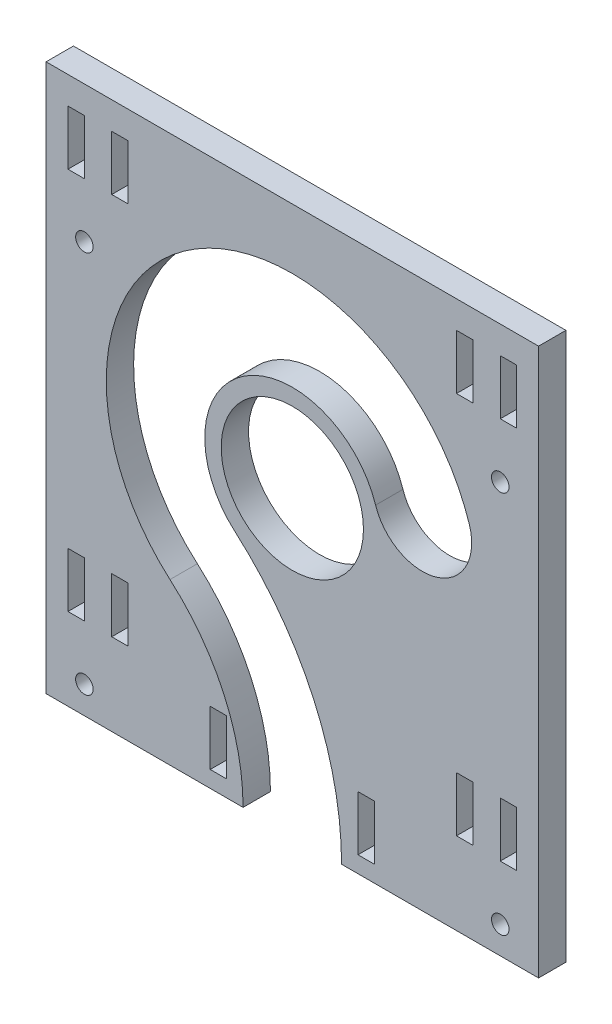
ISO-10303-21;
HEADER;
FILE_DESCRIPTION(('STEP AP214'),'2;1');
FILE_NAME('part.step','',(''),(''),'','','');
FILE_SCHEMA(('AUTOMOTIVE_DESIGN { 1 0 10303 214 1 1 1 1 }'));
ENDSEC;
DATA;
#1=APPLICATION_CONTEXT('core data for automotive mechanical design processes');
#2=APPLICATION_PROTOCOL_DEFINITION('international standard','automotive_design',2000,#1);
#3=PRODUCT_CONTEXT('',#1,'mechanical');
#4=PRODUCT('Part','Part','',(#3));
#5=PRODUCT_RELATED_PRODUCT_CATEGORY('part','',(#4));
#6=PRODUCT_DEFINITION_FORMATION('','',#4);
#7=PRODUCT_DEFINITION_CONTEXT('part definition',#1,'design');
#8=PRODUCT_DEFINITION('design','',#6,#7);
#9=PRODUCT_DEFINITION_SHAPE('','',#8);
#10=(LENGTH_UNIT() NAMED_UNIT(*) SI_UNIT(.MILLI.,.METRE.));
#11=(NAMED_UNIT(*) PLANE_ANGLE_UNIT() SI_UNIT($,.RADIAN.));
#12=(NAMED_UNIT(*) SI_UNIT($,.STERADIAN.) SOLID_ANGLE_UNIT());
#13=UNCERTAINTY_MEASURE_WITH_UNIT(LENGTH_MEASURE(1.E-05),#10,'distance_accuracy_value','');
#14=(GEOMETRIC_REPRESENTATION_CONTEXT(3) GLOBAL_UNCERTAINTY_ASSIGNED_CONTEXT((#13)) GLOBAL_UNIT_ASSIGNED_CONTEXT((#10,
#11,#12)) REPRESENTATION_CONTEXT('',''));
#15=CARTESIAN_POINT('',(0.,0.,0.));
#16=DIRECTION('',(0.,0.,1.));
#17=DIRECTION('',(1.,0.,0.));
#18=AXIS2_PLACEMENT_3D('',#15,#16,#17);
#19=CARTESIAN_POINT('',(23.7764129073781,7.72542485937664,5.));
#20=DIRECTION('',(0.,0.,-1.));
#21=DIRECTION('',(-1.,0.,0.));
#22=AXIS2_PLACEMENT_3D('',#19,#20,#21);
#23=CYLINDRICAL_SURFACE('',#22,8.99999999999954);
#24=CARTESIAN_POINT('',(23.7764129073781,7.72542485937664,0.));
#25=DIRECTION('',(0.,0.,1.));
#26=DIRECTION('',(1.,0.,0.));
#27=AXIS2_PLACEMENT_3D('',#24,#25,#26);
#28=CIRCLE('',#27,8.99999999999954);
#29=CARTESIAN_POINT('',(15.2169042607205,4.94427191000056,0.));
#30=VERTEX_POINT('',#29);
#31=CARTESIAN_POINT('',(32.3359215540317,10.5065778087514,0.));
#32=VERTEX_POINT('',#31);
#33=EDGE_CURVE('E619',#30,#32,#28,.T.);
#34=ORIENTED_EDGE('',*,*,#33,.F.);
#35=DIRECTION('',(0.,0.,-1.));
#36=VECTOR('',#35,1.);
#37=CARTESIAN_POINT('',(15.2169042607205,4.94427191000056,5.));
#38=LINE('',#37,#36);
#39=CARTESIAN_POINT('',(15.2169042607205,4.94427191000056,5.));
#40=VERTEX_POINT('',#39);
#41=EDGE_CURVE('E694',#40,#30,#38,.T.);
#42=ORIENTED_EDGE('',*,*,#41,.F.);
#43=CARTESIAN_POINT('',(23.7764129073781,7.72542485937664,5.));
#44=DIRECTION('',(0.,0.,1.));
#45=DIRECTION('',(1.,0.,0.));
#46=AXIS2_PLACEMENT_3D('',#43,#44,#45);
#47=CIRCLE('',#46,8.99999999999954);
#48=CARTESIAN_POINT('',(32.3359215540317,10.5065778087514,5.));
#49=VERTEX_POINT('',#48);
#50=EDGE_CURVE('E622',#40,#49,#47,.T.);
#51=ORIENTED_EDGE('',*,*,#50,.T.);
#52=DIRECTION('',(0.,0.,-1.));
#53=VECTOR('',#52,1.);
#54=CARTESIAN_POINT('',(32.3359215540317,10.5065778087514,5.));
#55=LINE('',#54,#53);
#56=EDGE_CURVE('E648',#49,#32,#55,.T.);
#57=ORIENTED_EDGE('',*,*,#56,.T.);
#58=EDGE_LOOP('',(#34,#42,#51,#57));
#59=FACE_BOUND('',#58,.T.);
#60=ADVANCED_FACE('F34',(#59),#23,.F.);
#61=CARTESIAN_POINT('',(0.,0.,5.));
#62=DIRECTION('',(0.,0.,-1.));
#63=DIRECTION('',(-1.,0.,0.));
#64=AXIS2_PLACEMENT_3D('',#61,#62,#63);
#65=CYLINDRICAL_SURFACE('',#64,15.9999999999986);
#66=CARTESIAN_POINT('',(0.,0.,0.));
#67=DIRECTION('',(0.,0.,1.));
#68=DIRECTION('',(1.,0.,0.));
#69=AXIS2_PLACEMENT_3D('',#66,#67,#68);
#70=CIRCLE('',#69,15.9999999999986);
#71=CARTESIAN_POINT('',(-10.5205479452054,-12.0547945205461,0.));
#72=VERTEX_POINT('',#71);
#73=EDGE_CURVE('E651',#30,#72,#70,.T.);
#74=ORIENTED_EDGE('',*,*,#73,.T.);
#75=DIRECTION('',(0.,0.,-1.));
#76=VECTOR('',#75,1.);
#77=CARTESIAN_POINT('',(-10.5205479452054,-12.0547945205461,5.));
#78=LINE('',#77,#76);
#79=CARTESIAN_POINT('',(-10.5205479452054,-12.0547945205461,5.));
#80=VERTEX_POINT('',#79);
#81=EDGE_CURVE('E692',#80,#72,#78,.T.);
#82=ORIENTED_EDGE('',*,*,#81,.F.);
#83=CARTESIAN_POINT('',(0.,0.,5.));
#84=DIRECTION('',(0.,0.,1.));
#85=DIRECTION('',(1.,0.,0.));
#86=AXIS2_PLACEMENT_3D('',#83,#84,#85);
#87=CIRCLE('',#86,15.9999999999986);
#88=EDGE_CURVE('E625',#40,#80,#87,.T.);
#89=ORIENTED_EDGE('',*,*,#88,.F.);
#90=ORIENTED_EDGE('',*,*,#41,.T.);
#91=EDGE_LOOP('',(#74,#82,#89,#90));
#92=FACE_BOUND('',#91,.T.);
#93=ADVANCED_FACE('F789',(#92),#65,.T.);
#94=CARTESIAN_POINT('',(-47.9999999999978,-55.,5.));
#95=DIRECTION('',(0.,0.,-1.));
#96=DIRECTION('',(-1.,0.,0.));
#97=AXIS2_PLACEMENT_3D('',#94,#95,#96);
#98=CYLINDRICAL_SURFACE('',#97,57.);
#99=CARTESIAN_POINT('',(-47.9999999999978,-55.,0.));
#100=DIRECTION('',(0.,0.,1.));
#101=DIRECTION('',(1.,0.,0.));
#102=AXIS2_PLACEMENT_3D('',#99,#100,#101);
#103=CIRCLE('',#102,57.);
#104=CARTESIAN_POINT('',(9.00000000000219,-55.0000000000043,0.));
#105=VERTEX_POINT('',#104);
#106=EDGE_CURVE('E654',#105,#72,#103,.T.);
#107=ORIENTED_EDGE('',*,*,#106,.F.);
#108=DIRECTION('',(0.,0.,-1.));
#109=VECTOR('',#108,1.);
#110=CARTESIAN_POINT('',(9.00000000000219,-55.0000000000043,5.));
#111=LINE('',#110,#109);
#112=CARTESIAN_POINT('',(9.00000000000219,-55.0000000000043,5.));
#113=VERTEX_POINT('',#112);
#114=EDGE_CURVE('E690',#113,#105,#111,.T.);
#115=ORIENTED_EDGE('',*,*,#114,.F.);
#116=CARTESIAN_POINT('',(-47.9999999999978,-55.,5.));
#117=DIRECTION('',(0.,0.,1.));
#118=DIRECTION('',(1.,0.,0.));
#119=AXIS2_PLACEMENT_3D('',#116,#117,#118);
#120=CIRCLE('',#119,57.);
#121=EDGE_CURVE('E628',#113,#80,#120,.T.);
#122=ORIENTED_EDGE('',*,*,#121,.T.);
#123=ORIENTED_EDGE('',*,*,#81,.T.);
#124=EDGE_LOOP('',(#107,#115,#122,#123));
#125=FACE_BOUND('',#124,.T.);
#126=ADVANCED_FACE('F794',(#125),#98,.F.);
#127=CARTESIAN_POINT('',(0.,-55.0000000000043,5.));
#128=DIRECTION('',(0.,1.,0.));
#129=DIRECTION('',(0.,0.,1.));
#130=AXIS2_PLACEMENT_3D('',#127,#128,#129);
#131=PLANE('',#130);
#132=DIRECTION('',(1.,0.,0.));
#133=VECTOR('',#132,1.);
#134=CARTESIAN_POINT('',(0.,-55.0000000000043,0.));
#135=LINE('',#134,#133);
#136=CARTESIAN_POINT('',(45.,-55.0000000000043,0.));
#137=VERTEX_POINT('',#136);
#138=EDGE_CURVE('E657',#105,#137,#135,.T.);
#139=ORIENTED_EDGE('',*,*,#138,.T.);
#140=DIRECTION('',(0.,0.,-1.));
#141=VECTOR('',#140,1.);
#142=CARTESIAN_POINT('',(45.,-55.0000000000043,5.));
#143=LINE('',#142,#141);
#144=CARTESIAN_POINT('',(45.,-55.0000000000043,5.));
#145=VERTEX_POINT('',#144);
#146=EDGE_CURVE('E687',#145,#137,#143,.T.);
#147=ORIENTED_EDGE('',*,*,#146,.F.);
#148=DIRECTION('',(1.,0.,0.));
#149=VECTOR('',#148,1.);
#150=CARTESIAN_POINT('',(0.,-55.0000000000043,5.));
#151=LINE('',#150,#149);
#152=EDGE_CURVE('E631',#113,#145,#151,.T.);
#153=ORIENTED_EDGE('',*,*,#152,.F.);
#154=ORIENTED_EDGE('',*,*,#114,.T.);
#155=EDGE_LOOP('',(#139,#147,#153,#154));
#156=FACE_BOUND('',#155,.T.);
#157=ADVANCED_FACE('F831',(#156),#131,.F.);
#158=CARTESIAN_POINT('',(44.9999999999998,1.87350135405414E-13,5.));
#159=DIRECTION('',(-1.,0.,0.));
#160=DIRECTION('',(0.,-1.,0.));
#161=AXIS2_PLACEMENT_3D('',#158,#159,#160);
#162=PLANE('',#161);
#163=DIRECTION('',(0.,1.,0.));
#164=VECTOR('',#163,1.);
#165=CARTESIAN_POINT('',(44.9999999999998,1.87350135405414E-13,0.));
#166=LINE('',#165,#164);
#167=CARTESIAN_POINT('',(45.,45.,0.));
#168=VERTEX_POINT('',#167);
#169=EDGE_CURVE('E659',#137,#168,#166,.T.);
#170=ORIENTED_EDGE('',*,*,#169,.T.);
#171=DIRECTION('',(0.,0.,-1.));
#172=VECTOR('',#171,1.);
#173=CARTESIAN_POINT('',(45.,45.,5.));
#174=LINE('',#173,#172);
#175=CARTESIAN_POINT('',(45.,45.,5.));
#176=VERTEX_POINT('',#175);
#177=EDGE_CURVE('E685',#176,#168,#174,.T.);
#178=ORIENTED_EDGE('',*,*,#177,.F.);
#179=DIRECTION('',(0.,1.,0.));
#180=VECTOR('',#179,1.);
#181=CARTESIAN_POINT('',(44.9999999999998,1.87350135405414E-13,5.));
#182=LINE('',#181,#180);
#183=EDGE_CURVE('E633',#145,#176,#182,.T.);
#184=ORIENTED_EDGE('',*,*,#183,.F.);
#185=ORIENTED_EDGE('',*,*,#146,.T.);
#186=EDGE_LOOP('',(#170,#178,#184,#185));
#187=FACE_BOUND('',#186,.T.);
#188=ADVANCED_FACE('F826',(#187),#162,.F.);
#189=CARTESIAN_POINT('',(0.,45.,5.));
#190=DIRECTION('',(0.,1.,0.));
#191=DIRECTION('',(0.,0.,1.));
#192=AXIS2_PLACEMENT_3D('',#189,#190,#191);
#193=PLANE('',#192);
#194=DIRECTION('',(1.,0.,0.));
#195=VECTOR('',#194,1.);
#196=CARTESIAN_POINT('',(0.,45.,0.));
#197=LINE('',#196,#195);
#198=CARTESIAN_POINT('',(-45.,45.,0.));
#199=VERTEX_POINT('',#198);
#200=EDGE_CURVE('E662',#199,#168,#197,.T.);
#201=ORIENTED_EDGE('',*,*,#200,.F.);
#202=DIRECTION('',(0.,0.,-1.));
#203=VECTOR('',#202,1.);
#204=CARTESIAN_POINT('',(-45.,45.,5.));
#205=LINE('',#204,#203);
#206=CARTESIAN_POINT('',(-45.,45.,5.));
#207=VERTEX_POINT('',#206);
#208=EDGE_CURVE('E683',#207,#199,#205,.T.);
#209=ORIENTED_EDGE('',*,*,#208,.F.);
#210=DIRECTION('',(1.,0.,0.));
#211=VECTOR('',#210,1.);
#212=CARTESIAN_POINT('',(0.,45.,5.));
#213=LINE('',#212,#211);
#214=EDGE_CURVE('E635',#207,#176,#213,.T.);
#215=ORIENTED_EDGE('',*,*,#214,.T.);
#216=ORIENTED_EDGE('',*,*,#177,.T.);
#217=EDGE_LOOP('',(#201,#209,#215,#216));
#218=FACE_BOUND('',#217,.T.);
#219=ADVANCED_FACE('F820',(#218),#193,.T.);
#220=CARTESIAN_POINT('',(-45.,0.,5.));
#221=DIRECTION('',(-1.,0.,0.));
#222=DIRECTION('',(0.,-1.,0.));
#223=AXIS2_PLACEMENT_3D('',#220,#221,#222);
#224=PLANE('',#223);
#225=DIRECTION('',(0.,1.,0.));
#226=VECTOR('',#225,1.);
#227=CARTESIAN_POINT('',(-45.,0.,0.));
#228=LINE('',#227,#226);
#229=CARTESIAN_POINT('',(-45.,-55.,0.));
#230=VERTEX_POINT('',#229);
#231=EDGE_CURVE('E665',#230,#199,#228,.T.);
#232=ORIENTED_EDGE('',*,*,#231,.F.);
#233=DIRECTION('',(0.,0.,-1.));
#234=VECTOR('',#233,1.);
#235=CARTESIAN_POINT('',(-45.,-55.,5.));
#236=LINE('',#235,#234);
#237=CARTESIAN_POINT('',(-45.,-55.,5.));
#238=VERTEX_POINT('',#237);
#239=EDGE_CURVE('E681',#238,#230,#236,.T.);
#240=ORIENTED_EDGE('',*,*,#239,.F.);
#241=DIRECTION('',(0.,1.,0.));
#242=VECTOR('',#241,1.);
#243=CARTESIAN_POINT('',(-45.,0.,5.));
#244=LINE('',#243,#242);
#245=EDGE_CURVE('E638',#238,#207,#244,.T.);
#246=ORIENTED_EDGE('',*,*,#245,.T.);
#247=ORIENTED_EDGE('',*,*,#208,.T.);
#248=EDGE_LOOP('',(#232,#240,#246,#247));
#249=FACE_BOUND('',#248,.T.);
#250=ADVANCED_FACE('F814',(#249),#224,.T.);
#251=CARTESIAN_POINT('',(0.,-55.,5.));
#252=DIRECTION('',(0.,1.,0.));
#253=DIRECTION('',(0.,0.,1.));
#254=AXIS2_PLACEMENT_3D('',#251,#252,#253);
#255=PLANE('',#254);
#256=DIRECTION('',(1.,0.,0.));
#257=VECTOR('',#256,1.);
#258=CARTESIAN_POINT('',(0.,-55.,0.));
#259=LINE('',#258,#257);
#260=CARTESIAN_POINT('',(-8.99999999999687,-55.,0.));
#261=VERTEX_POINT('',#260);
#262=EDGE_CURVE('E668',#230,#261,#259,.T.);
#263=ORIENTED_EDGE('',*,*,#262,.T.);
#264=DIRECTION('',(0.,0.,-1.));
#265=VECTOR('',#264,1.);
#266=CARTESIAN_POINT('',(-8.99999999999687,-55.,5.));
#267=LINE('',#266,#265);
#268=CARTESIAN_POINT('',(-8.99999999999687,-55.,5.));
#269=VERTEX_POINT('',#268);
#270=EDGE_CURVE('E678',#269,#261,#267,.T.);
#271=ORIENTED_EDGE('',*,*,#270,.F.);
#272=DIRECTION('',(1.,0.,0.));
#273=VECTOR('',#272,1.);
#274=CARTESIAN_POINT('',(0.,-55.,5.));
#275=LINE('',#274,#273);
#276=EDGE_CURVE('E641',#238,#269,#275,.T.);
#277=ORIENTED_EDGE('',*,*,#276,.F.);
#278=ORIENTED_EDGE('',*,*,#239,.T.);
#279=EDGE_LOOP('',(#263,#271,#277,#278));
#280=FACE_BOUND('',#279,.T.);
#281=ADVANCED_FACE('F837',(#280),#255,.F.);
#282=CARTESIAN_POINT('',(-47.9999999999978,-55.,5.));
#283=DIRECTION('',(0.,0.,-1.));
#284=DIRECTION('',(-1.,0.,0.));
#285=AXIS2_PLACEMENT_3D('',#282,#283,#284);
#286=CYLINDRICAL_SURFACE('',#285,39.0000000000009);
#287=CARTESIAN_POINT('',(-47.9999999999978,-55.,0.));
#288=DIRECTION('',(0.,0.,1.));
#289=DIRECTION('',(1.,0.,0.));
#290=AXIS2_PLACEMENT_3D('',#287,#288,#289);
#291=CIRCLE('',#290,39.0000000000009);
#292=CARTESIAN_POINT('',(-22.3561643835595,-25.6164383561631,0.));
#293=VERTEX_POINT('',#292);
#294=EDGE_CURVE('E670',#261,#293,#291,.T.);
#295=ORIENTED_EDGE('',*,*,#294,.T.);
#296=DIRECTION('',(0.,0.,-1.));
#297=VECTOR('',#296,1.);
#298=CARTESIAN_POINT('',(-22.3561643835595,-25.6164383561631,5.));
#299=LINE('',#298,#297);
#300=CARTESIAN_POINT('',(-22.3561643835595,-25.6164383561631,5.));
#301=VERTEX_POINT('',#300);
#302=EDGE_CURVE('E676',#301,#293,#299,.T.);
#303=ORIENTED_EDGE('',*,*,#302,.F.);
#304=CARTESIAN_POINT('',(-47.9999999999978,-55.,5.));
#305=DIRECTION('',(0.,0.,1.));
#306=DIRECTION('',(1.,0.,0.));
#307=AXIS2_PLACEMENT_3D('',#304,#305,#306);
#308=CIRCLE('',#307,39.0000000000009);
#309=EDGE_CURVE('E643',#269,#301,#308,.T.);
#310=ORIENTED_EDGE('',*,*,#309,.F.);
#311=ORIENTED_EDGE('',*,*,#270,.T.);
#312=EDGE_LOOP('',(#295,#303,#310,#311));
#313=FACE_BOUND('',#312,.T.);
#314=ADVANCED_FACE('F808',(#313),#286,.T.);
#315=CARTESIAN_POINT('',(0.,0.,5.));
#316=DIRECTION('',(0.,0.,-1.));
#317=DIRECTION('',(-1.,0.,0.));
#318=AXIS2_PLACEMENT_3D('',#315,#316,#317);
#319=CYLINDRICAL_SURFACE('',#318,33.9999999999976);
#320=CARTESIAN_POINT('',(0.,0.,0.));
#321=DIRECTION('',(0.,0.,1.));
#322=DIRECTION('',(1.,0.,0.));
#323=AXIS2_PLACEMENT_3D('',#320,#321,#322);
#324=CIRCLE('',#323,33.9999999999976);
#325=EDGE_CURVE('E626',#32,#293,#324,.T.);
#326=ORIENTED_EDGE('',*,*,#325,.F.);
#327=ORIENTED_EDGE('',*,*,#56,.F.);
#328=CARTESIAN_POINT('',(0.,0.,5.));
#329=DIRECTION('',(0.,0.,1.));
#330=DIRECTION('',(1.,0.,0.));
#331=AXIS2_PLACEMENT_3D('',#328,#329,#330);
#332=CIRCLE('',#331,33.9999999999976);
#333=EDGE_CURVE('E645',#49,#301,#332,.T.);
#334=ORIENTED_EDGE('',*,*,#333,.T.);
#335=ORIENTED_EDGE('',*,*,#302,.T.);
#336=EDGE_LOOP('',(#326,#327,#334,#335));
#337=FACE_BOUND('',#336,.T.);
#338=ADVANCED_FACE('F803',(#337),#319,.F.);
#339=CARTESIAN_POINT('',(0.,0.,5.));
#340=DIRECTION('',(0.,0.,1.));
#341=DIRECTION('',(1.,0.,0.));
#342=AXIS2_PLACEMENT_3D('',#339,#340,#341);
#343=PLANE('',#342);
#344=DIRECTION('',(-1.,0.,0.));
#345=VECTOR('',#344,1.);
#346=CARTESIAN_POINT('',(-38.,-30.,5.));
#347=LINE('',#346,#345);
#348=CARTESIAN_POINT('',(-38.,-30.,5.));
#349=VERTEX_POINT('',#348);
#350=CARTESIAN_POINT('',(-41.,-30.,5.));
#351=VERTEX_POINT('',#350);
#352=EDGE_CURVE('E48',#349,#351,#347,.T.);
#353=ORIENTED_EDGE('',*,*,#352,.F.);
#354=DIRECTION('',(0.,1.,0.));
#355=VECTOR('',#354,1.);
#356=CARTESIAN_POINT('',(-38.,-40.,5.));
#357=LINE('',#356,#355);
#358=CARTESIAN_POINT('',(-38.,-40.,5.));
#359=VERTEX_POINT('',#358);
#360=EDGE_CURVE('E374',#359,#349,#357,.T.);
#361=ORIENTED_EDGE('',*,*,#360,.F.);
#362=DIRECTION('',(1.,0.,0.));
#363=VECTOR('',#362,1.);
#364=CARTESIAN_POINT('',(-41.,-40.,5.));
#365=LINE('',#364,#363);
#366=CARTESIAN_POINT('',(-41.,-40.,5.));
#367=VERTEX_POINT('',#366);
#368=EDGE_CURVE('E357',#367,#359,#365,.T.);
#369=ORIENTED_EDGE('',*,*,#368,.F.);
#370=DIRECTION('',(0.,-1.,0.));
#371=VECTOR('',#370,1.);
#372=CARTESIAN_POINT('',(-41.,-30.,5.));
#373=LINE('',#372,#371);
#374=EDGE_CURVE('E367',#351,#367,#373,.T.);
#375=ORIENTED_EDGE('',*,*,#374,.F.);
#376=EDGE_LOOP('',(#353,#361,#369,#375));
#377=FACE_BOUND('',#376,.T.);
#378=CARTESIAN_POINT('',(-38.,-50.,5.));
#379=DIRECTION('',(0.,0.,1.));
#380=DIRECTION('',(1.,0.,0.));
#381=AXIS2_PLACEMENT_3D('',#378,#379,#380);
#382=CIRCLE('',#381,1.6);
#383=CARTESIAN_POINT('',(-36.4,-50.,5.));
#384=VERTEX_POINT('',#383);
#385=EDGE_CURVE('E383',#384,#384,#382,.T.);
#386=ORIENTED_EDGE('',*,*,#385,.F.);
#387=EDGE_LOOP('',(#386));
#388=FACE_BOUND('',#387,.T.);
#389=CARTESIAN_POINT('',(38.,-50.,5.));
#390=DIRECTION('',(0.,0.,1.));
#391=DIRECTION('',(-1.,0.,0.));
#392=AXIS2_PLACEMENT_3D('',#389,#390,#391);
#393=CIRCLE('',#392,1.6);
#394=CARTESIAN_POINT('',(36.4,-50.,5.));
#395=VERTEX_POINT('',#394);
#396=EDGE_CURVE('E386',#395,#395,#393,.T.);
#397=ORIENTED_EDGE('',*,*,#396,.F.);
#398=EDGE_LOOP('',(#397));
#399=FACE_BOUND('',#398,.T.);
#400=CARTESIAN_POINT('',(-38.,20.,5.));
#401=DIRECTION('',(0.,0.,1.));
#402=DIRECTION('',(1.,0.,0.));
#403=AXIS2_PLACEMENT_3D('',#400,#401,#402);
#404=CIRCLE('',#403,1.6);
#405=CARTESIAN_POINT('',(-36.4,20.,5.));
#406=VERTEX_POINT('',#405);
#407=EDGE_CURVE('E1424',#406,#406,#404,.T.);
#408=ORIENTED_EDGE('',*,*,#407,.F.);
#409=EDGE_LOOP('',(#408));
#410=FACE_BOUND('',#409,.T.);
#411=DIRECTION('',(0.,1.,0.));
#412=VECTOR('',#411,1.);
#413=CARTESIAN_POINT('',(-38.,30.,5.));
#414=LINE('',#413,#412);
#415=CARTESIAN_POINT('',(-38.,30.,5.));
#416=VERTEX_POINT('',#415);
#417=CARTESIAN_POINT('',(-38.,40.,5.));
#418=VERTEX_POINT('',#417);
#419=EDGE_CURVE('E56',#416,#418,#414,.T.);
#420=ORIENTED_EDGE('',*,*,#419,.F.);
#421=DIRECTION('',(1.,0.,0.));
#422=VECTOR('',#421,1.);
#423=CARTESIAN_POINT('',(-41.,30.,5.));
#424=LINE('',#423,#422);
#425=CARTESIAN_POINT('',(-41.,30.,5.));
#426=VERTEX_POINT('',#425);
#427=EDGE_CURVE('E456',#426,#416,#424,.T.);
#428=ORIENTED_EDGE('',*,*,#427,.F.);
#429=DIRECTION('',(0.,-1.,0.));
#430=VECTOR('',#429,1.);
#431=CARTESIAN_POINT('',(-41.,40.,5.));
#432=LINE('',#431,#430);
#433=CARTESIAN_POINT('',(-41.,40.,5.));
#434=VERTEX_POINT('',#433);
#435=EDGE_CURVE('E453',#434,#426,#432,.T.);
#436=ORIENTED_EDGE('',*,*,#435,.F.);
#437=DIRECTION('',(-1.,0.,0.));
#438=VECTOR('',#437,1.);
#439=CARTESIAN_POINT('',(-38.,40.,5.));
#440=LINE('',#439,#438);
#441=EDGE_CURVE('E450',#418,#434,#440,.T.);
#442=ORIENTED_EDGE('',*,*,#441,.F.);
#443=EDGE_LOOP('',(#420,#428,#436,#442));
#444=FACE_BOUND('',#443,.T.);
#445=DIRECTION('',(1.,0.,0.));
#446=VECTOR('',#445,1.);
#447=CARTESIAN_POINT('',(41.,30.,5.));
#448=LINE('',#447,#446);
#449=CARTESIAN_POINT('',(38.,30.,5.));
#450=VERTEX_POINT('',#449);
#451=CARTESIAN_POINT('',(41.,30.,5.));
#452=VERTEX_POINT('',#451);
#453=EDGE_CURVE('E429',#450,#452,#448,.T.);
#454=ORIENTED_EDGE('',*,*,#453,.F.);
#455=DIRECTION('',(0.,-1.,0.));
#456=VECTOR('',#455,1.);
#457=CARTESIAN_POINT('',(38.,30.,5.));
#458=LINE('',#457,#456);
#459=CARTESIAN_POINT('',(38.,40.,5.));
#460=VERTEX_POINT('',#459);
#461=EDGE_CURVE('E438',#460,#450,#458,.T.);
#462=ORIENTED_EDGE('',*,*,#461,.F.);
#463=DIRECTION('',(-1.,0.,0.));
#464=VECTOR('',#463,1.);
#465=CARTESIAN_POINT('',(38.,40.,5.));
#466=LINE('',#465,#464);
#467=CARTESIAN_POINT('',(41.,40.,5.));
#468=VERTEX_POINT('',#467);
#469=EDGE_CURVE('E435',#468,#460,#466,.T.);
#470=ORIENTED_EDGE('',*,*,#469,.F.);
#471=DIRECTION('',(0.,1.,0.));
#472=VECTOR('',#471,1.);
#473=CARTESIAN_POINT('',(41.,40.,5.));
#474=LINE('',#473,#472);
#475=EDGE_CURVE('E431',#452,#468,#474,.T.);
#476=ORIENTED_EDGE('',*,*,#475,.F.);
#477=EDGE_LOOP('',(#454,#462,#470,#476));
#478=FACE_BOUND('',#477,.T.);
#479=DIRECTION('',(-1.,0.,0.));
#480=VECTOR('',#479,1.);
#481=CARTESIAN_POINT('',(41.,-30.,5.));
#482=LINE('',#481,#480);
#483=CARTESIAN_POINT('',(41.,-30.,5.));
#484=VERTEX_POINT('',#483);
#485=CARTESIAN_POINT('',(38.,-30.,5.));
#486=VERTEX_POINT('',#485);
#487=EDGE_CURVE('E409',#484,#486,#482,.T.);
#488=ORIENTED_EDGE('',*,*,#487,.F.);
#489=DIRECTION('',(0.,1.,0.));
#490=VECTOR('',#489,1.);
#491=CARTESIAN_POINT('',(41.,-40.,5.));
#492=LINE('',#491,#490);
#493=CARTESIAN_POINT('',(41.,-40.,5.));
#494=VERTEX_POINT('',#493);
#495=EDGE_CURVE('E418',#494,#484,#492,.T.);
#496=ORIENTED_EDGE('',*,*,#495,.F.);
#497=DIRECTION('',(1.,0.,0.));
#498=VECTOR('',#497,1.);
#499=CARTESIAN_POINT('',(38.,-40.,5.));
#500=LINE('',#499,#498);
#501=CARTESIAN_POINT('',(38.,-40.,5.));
#502=VERTEX_POINT('',#501);
#503=EDGE_CURVE('E415',#502,#494,#500,.T.);
#504=ORIENTED_EDGE('',*,*,#503,.F.);
#505=DIRECTION('',(0.,-1.,0.));
#506=VECTOR('',#505,1.);
#507=CARTESIAN_POINT('',(38.,-30.,5.));
#508=LINE('',#507,#506);
#509=EDGE_CURVE('E411',#486,#502,#508,.T.);
#510=ORIENTED_EDGE('',*,*,#509,.F.);
#511=EDGE_LOOP('',(#488,#496,#504,#510));
#512=FACE_BOUND('',#511,.T.);
#513=DIRECTION('',(-1.,0.,0.));
#514=VECTOR('',#513,1.);
#515=CARTESIAN_POINT('',(15.,-42.0000000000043,5.));
#516=LINE('',#515,#514);
#517=CARTESIAN_POINT('',(15.,-42.0000000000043,5.));
#518=VERTEX_POINT('',#517);
#519=CARTESIAN_POINT('',(12.,-42.0000000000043,5.));
#520=VERTEX_POINT('',#519);
#521=EDGE_CURVE('E387',#518,#520,#516,.T.);
#522=ORIENTED_EDGE('',*,*,#521,.F.);
#523=DIRECTION('',(0.,1.,0.));
#524=VECTOR('',#523,1.);
#525=CARTESIAN_POINT('',(15.,-52.0000000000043,5.));
#526=LINE('',#525,#524);
#527=CARTESIAN_POINT('',(15.,-52.0000000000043,5.));
#528=VERTEX_POINT('',#527);
#529=EDGE_CURVE('E396',#528,#518,#526,.T.);
#530=ORIENTED_EDGE('',*,*,#529,.F.);
#531=DIRECTION('',(1.,0.,0.));
#532=VECTOR('',#531,1.);
#533=CARTESIAN_POINT('',(12.,-52.0000000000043,5.));
#534=LINE('',#533,#532);
#535=CARTESIAN_POINT('',(12.,-52.0000000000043,5.));
#536=VERTEX_POINT('',#535);
#537=EDGE_CURVE('E393',#536,#528,#534,.T.);
#538=ORIENTED_EDGE('',*,*,#537,.F.);
#539=DIRECTION('',(0.,-1.,0.));
#540=VECTOR('',#539,1.);
#541=CARTESIAN_POINT('',(12.,-42.0000000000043,5.));
#542=LINE('',#541,#540);
#543=EDGE_CURVE('E389',#520,#536,#542,.T.);
#544=ORIENTED_EDGE('',*,*,#543,.F.);
#545=EDGE_LOOP('',(#522,#530,#538,#544));
#546=FACE_BOUND('',#545,.T.);
#547=CARTESIAN_POINT('',(38.,20.,5.));
#548=DIRECTION('',(0.,0.,1.));
#549=DIRECTION('',(-1.,0.,0.));
#550=AXIS2_PLACEMENT_3D('',#547,#548,#549);
#551=CIRCLE('',#550,1.6);
#552=CARTESIAN_POINT('',(36.4,20.,5.));
#553=VERTEX_POINT('',#552);
#554=EDGE_CURVE('E1423',#553,#553,#551,.T.);
#555=ORIENTED_EDGE('',*,*,#554,.F.);
#556=EDGE_LOOP('',(#555));
#557=FACE_BOUND('',#556,.T.);
#558=DIRECTION('',(0.,-1.,0.));
#559=VECTOR('',#558,1.);
#560=CARTESIAN_POINT('',(-15.,-52.,5.));
#561=LINE('',#560,#559);
#562=CARTESIAN_POINT('',(-15.,-42.,5.));
#563=VERTEX_POINT('',#562);
#564=CARTESIAN_POINT('',(-15.,-52.,5.));
#565=VERTEX_POINT('',#564);
#566=EDGE_CURVE('E402',#563,#565,#561,.T.);
#567=ORIENTED_EDGE('',*,*,#566,.F.);
#568=DIRECTION('',(-1.,0.,0.));
#569=VECTOR('',#568,1.);
#570=CARTESIAN_POINT('',(-15.,-42.,5.));
#571=LINE('',#570,#569);
#572=CARTESIAN_POINT('',(-12.,-42.,5.));
#573=VERTEX_POINT('',#572);
#574=EDGE_CURVE('E473',#573,#563,#571,.T.);
#575=ORIENTED_EDGE('',*,*,#574,.F.);
#576=DIRECTION('',(0.,1.,0.));
#577=VECTOR('',#576,1.);
#578=CARTESIAN_POINT('',(-12.,-42.,5.));
#579=LINE('',#578,#577);
#580=CARTESIAN_POINT('',(-12.,-52.,5.));
#581=VERTEX_POINT('',#580);
#582=EDGE_CURVE('E470',#581,#573,#579,.T.);
#583=ORIENTED_EDGE('',*,*,#582,.F.);
#584=DIRECTION('',(1.,0.,0.));
#585=VECTOR('',#584,1.);
#586=CARTESIAN_POINT('',(-12.,-52.,5.));
#587=LINE('',#586,#585);
#588=EDGE_CURVE('E467',#565,#581,#587,.T.);
#589=ORIENTED_EDGE('',*,*,#588,.F.);
#590=EDGE_LOOP('',(#567,#575,#583,#589));
#591=FACE_BOUND('',#590,.T.);
#592=DIRECTION('',(-1.,0.,0.));
#593=VECTOR('',#592,1.);
#594=CARTESIAN_POINT('',(33.,40.,5.));
#595=LINE('',#594,#593);
#596=CARTESIAN_POINT('',(33.,40.,5.));
#597=VERTEX_POINT('',#596);
#598=CARTESIAN_POINT('',(30.,40.,5.));
#599=VERTEX_POINT('',#598);
#600=EDGE_CURVE('E534',#597,#599,#595,.T.);
#601=ORIENTED_EDGE('',*,*,#600,.F.);
#602=DIRECTION('',(0.,1.,0.));
#603=VECTOR('',#602,1.);
#604=CARTESIAN_POINT('',(33.,30.,5.));
#605=LINE('',#604,#603);
#606=CARTESIAN_POINT('',(33.,30.,5.));
#607=VERTEX_POINT('',#606);
#608=EDGE_CURVE('E524',#607,#597,#605,.T.);
#609=ORIENTED_EDGE('',*,*,#608,.F.);
#610=DIRECTION('',(1.,0.,0.));
#611=VECTOR('',#610,1.);
#612=CARTESIAN_POINT('',(30.,30.,5.));
#613=LINE('',#612,#611);
#614=CARTESIAN_POINT('',(30.,30.,5.));
#615=VERTEX_POINT('',#614);
#616=EDGE_CURVE('E540',#615,#607,#613,.T.);
#617=ORIENTED_EDGE('',*,*,#616,.F.);
#618=DIRECTION('',(0.,-1.,0.));
#619=VECTOR('',#618,1.);
#620=CARTESIAN_POINT('',(30.,40.,5.));
#621=LINE('',#620,#619);
#622=EDGE_CURVE('E536',#599,#615,#621,.T.);
#623=ORIENTED_EDGE('',*,*,#622,.F.);
#624=EDGE_LOOP('',(#601,#609,#617,#623));
#625=FACE_BOUND('',#624,.T.);
#626=DIRECTION('',(-1.,0.,0.));
#627=VECTOR('',#626,1.);
#628=CARTESIAN_POINT('',(-30.,-30.,5.));
#629=LINE('',#628,#627);
#630=CARTESIAN_POINT('',(-30.,-30.,5.));
#631=VERTEX_POINT('',#630);
#632=CARTESIAN_POINT('',(-33.,-30.,5.));
#633=VERTEX_POINT('',#632);
#634=EDGE_CURVE('E513',#631,#633,#629,.T.);
#635=ORIENTED_EDGE('',*,*,#634,.F.);
#636=DIRECTION('',(0.,1.,0.));
#637=VECTOR('',#636,1.);
#638=CARTESIAN_POINT('',(-30.,-40.,5.));
#639=LINE('',#638,#637);
#640=CARTESIAN_POINT('',(-30.,-40.,5.));
#641=VERTEX_POINT('',#640);
#642=EDGE_CURVE('E558',#641,#631,#639,.T.);
#643=ORIENTED_EDGE('',*,*,#642,.F.);
#644=DIRECTION('',(1.,0.,0.));
#645=VECTOR('',#644,1.);
#646=CARTESIAN_POINT('',(-33.,-40.,5.));
#647=LINE('',#646,#645);
#648=CARTESIAN_POINT('',(-33.,-40.,5.));
#649=VERTEX_POINT('',#648);
#650=EDGE_CURVE('E572',#649,#641,#647,.T.);
#651=ORIENTED_EDGE('',*,*,#650,.F.);
#652=DIRECTION('',(0.,-1.,0.));
#653=VECTOR('',#652,1.);
#654=CARTESIAN_POINT('',(-33.,-30.,5.));
#655=LINE('',#654,#653);
#656=EDGE_CURVE('E569',#633,#649,#655,.T.);
#657=ORIENTED_EDGE('',*,*,#656,.F.);
#658=EDGE_LOOP('',(#635,#643,#651,#657));
#659=FACE_BOUND('',#658,.T.);
#660=DIRECTION('',(-1.,0.,0.));
#661=VECTOR('',#660,1.);
#662=CARTESIAN_POINT('',(33.,-30.,5.));
#663=LINE('',#662,#661);
#664=CARTESIAN_POINT('',(33.,-30.,5.));
#665=VERTEX_POINT('',#664);
#666=CARTESIAN_POINT('',(30.,-30.,5.));
#667=VERTEX_POINT('',#666);
#668=EDGE_CURVE('E500',#665,#667,#663,.T.);
#669=ORIENTED_EDGE('',*,*,#668,.F.);
#670=DIRECTION('',(0.,1.,0.));
#671=VECTOR('',#670,1.);
#672=CARTESIAN_POINT('',(33.,-40.,5.));
#673=LINE('',#672,#671);
#674=CARTESIAN_POINT('',(33.,-40.,5.));
#675=VERTEX_POINT('',#674);
#676=EDGE_CURVE('E490',#675,#665,#673,.T.);
#677=ORIENTED_EDGE('',*,*,#676,.F.);
#678=DIRECTION('',(1.,0.,0.));
#679=VECTOR('',#678,1.);
#680=CARTESIAN_POINT('',(30.,-40.,5.));
#681=LINE('',#680,#679);
#682=CARTESIAN_POINT('',(30.,-40.,5.));
#683=VERTEX_POINT('',#682);
#684=EDGE_CURVE('E506',#683,#675,#681,.T.);
#685=ORIENTED_EDGE('',*,*,#684,.F.);
#686=DIRECTION('',(0.,-1.,0.));
#687=VECTOR('',#686,1.);
#688=CARTESIAN_POINT('',(30.,-30.,5.));
#689=LINE('',#688,#687);
#690=EDGE_CURVE('E502',#667,#683,#689,.T.);
#691=ORIENTED_EDGE('',*,*,#690,.F.);
#692=EDGE_LOOP('',(#669,#677,#685,#691));
#693=FACE_BOUND('',#692,.T.);
#694=DIRECTION('',(-1.,0.,0.));
#695=VECTOR('',#694,1.);
#696=CARTESIAN_POINT('',(-30.,40.,5.));
#697=LINE('',#696,#695);
#698=CARTESIAN_POINT('',(-30.,40.,5.));
#699=VERTEX_POINT('',#698);
#700=CARTESIAN_POINT('',(-33.,40.,5.));
#701=VERTEX_POINT('',#700);
#702=EDGE_CURVE('E547',#699,#701,#697,.T.);
#703=ORIENTED_EDGE('',*,*,#702,.F.);
#704=DIRECTION('',(0.,1.,0.));
#705=VECTOR('',#704,1.);
#706=CARTESIAN_POINT('',(-30.,30.,5.));
#707=LINE('',#706,#705);
#708=CARTESIAN_POINT('',(-30.,30.,5.));
#709=VERTEX_POINT('',#708);
#710=EDGE_CURVE('E588',#709,#699,#707,.T.);
#711=ORIENTED_EDGE('',*,*,#710,.F.);
#712=DIRECTION('',(1.,0.,0.));
#713=VECTOR('',#712,1.);
#714=CARTESIAN_POINT('',(-33.,30.,5.));
#715=LINE('',#714,#713);
#716=CARTESIAN_POINT('',(-33.,30.,5.));
#717=VERTEX_POINT('',#716);
#718=EDGE_CURVE('E602',#717,#709,#715,.T.);
#719=ORIENTED_EDGE('',*,*,#718,.F.);
#720=DIRECTION('',(0.,-1.,0.));
#721=VECTOR('',#720,1.);
#722=CARTESIAN_POINT('',(-33.,40.,5.));
#723=LINE('',#722,#721);
#724=EDGE_CURVE('E599',#701,#717,#723,.T.);
#725=ORIENTED_EDGE('',*,*,#724,.F.);
#726=EDGE_LOOP('',(#703,#711,#719,#725));
#727=FACE_BOUND('',#726,.T.);
#728=CARTESIAN_POINT('',(0.,0.,5.));
#729=DIRECTION('',(0.,0.,1.));
#730=DIRECTION('',(1.,0.,0.));
#731=AXIS2_PLACEMENT_3D('',#728,#729,#730);
#732=CIRCLE('',#731,13.);
#733=CARTESIAN_POINT('',(13.,0.,5.));
#734=VERTEX_POINT('',#733);
#735=EDGE_CURVE('E609',#734,#734,#732,.T.);
#736=ORIENTED_EDGE('',*,*,#735,.F.);
#737=EDGE_LOOP('',(#736));
#738=FACE_BOUND('',#737,.T.);
#739=ORIENTED_EDGE('',*,*,#50,.F.);
#740=ORIENTED_EDGE('',*,*,#88,.T.);
#741=ORIENTED_EDGE('',*,*,#121,.F.);
#742=ORIENTED_EDGE('',*,*,#152,.T.);
#743=ORIENTED_EDGE('',*,*,#183,.T.);
#744=ORIENTED_EDGE('',*,*,#214,.F.);
#745=ORIENTED_EDGE('',*,*,#245,.F.);
#746=ORIENTED_EDGE('',*,*,#276,.T.);
#747=ORIENTED_EDGE('',*,*,#309,.T.);
#748=ORIENTED_EDGE('',*,*,#333,.F.);
#749=EDGE_LOOP('',(#739,#740,#741,#742,#743,#744,#745,#746,#747,#748));
#750=FACE_BOUND('',#749,.T.);
#751=ADVANCED_FACE('F371',(#377,#388,#399,#410,#444,#478,#512,#546,#557,#591,#625,#659,#693,
#727,#738,#750),#343,.T.);
#752=CARTESIAN_POINT('',(0.,0.,0.));
#753=DIRECTION('',(0.,0.,1.));
#754=DIRECTION('',(1.,0.,0.));
#755=AXIS2_PLACEMENT_3D('',#752,#753,#754);
#756=PLANE('',#755);
#757=DIRECTION('',(0.,1.,0.));
#758=VECTOR('',#757,1.);
#759=CARTESIAN_POINT('',(-38.,0.,0.));
#760=LINE('',#759,#758);
#761=CARTESIAN_POINT('',(-38.,-40.,0.));
#762=VERTEX_POINT('',#761);
#763=CARTESIAN_POINT('',(-38.,-30.,0.));
#764=VERTEX_POINT('',#763);
#765=EDGE_CURVE('E41',#762,#764,#760,.T.);
#766=ORIENTED_EDGE('',*,*,#765,.T.);
#767=DIRECTION('',(-1.,0.,0.));
#768=VECTOR('',#767,1.);
#769=CARTESIAN_POINT('',(0.,-30.,0.));
#770=LINE('',#769,#768);
#771=CARTESIAN_POINT('',(-41.,-30.,0.));
#772=VERTEX_POINT('',#771);
#773=EDGE_CURVE('E11',#764,#772,#770,.T.);
#774=ORIENTED_EDGE('',*,*,#773,.T.);
#775=DIRECTION('',(0.,-1.,0.));
#776=VECTOR('',#775,1.);
#777=CARTESIAN_POINT('',(-41.,0.,0.));
#778=LINE('',#777,#776);
#779=CARTESIAN_POINT('',(-41.,-40.,0.));
#780=VERTEX_POINT('',#779);
#781=EDGE_CURVE('E759',#772,#780,#778,.T.);
#782=ORIENTED_EDGE('',*,*,#781,.T.);
#783=DIRECTION('',(1.,0.,0.));
#784=VECTOR('',#783,1.);
#785=CARTESIAN_POINT('',(0.,-40.,0.));
#786=LINE('',#785,#784);
#787=EDGE_CURVE('E360',#780,#762,#786,.T.);
#788=ORIENTED_EDGE('',*,*,#787,.T.);
#789=EDGE_LOOP('',(#766,#774,#782,#788));
#790=FACE_BOUND('',#789,.T.);
#791=CARTESIAN_POINT('',(-38.,-50.,0.));
#792=DIRECTION('',(0.,0.,1.));
#793=DIRECTION('',(1.,0.,0.));
#794=AXIS2_PLACEMENT_3D('',#791,#792,#793);
#795=CIRCLE('',#794,1.6);
#796=CARTESIAN_POINT('',(-36.4,-50.,0.));
#797=VERTEX_POINT('',#796);
#798=EDGE_CURVE('E503',#797,#797,#795,.T.);
#799=ORIENTED_EDGE('',*,*,#798,.T.);
#800=EDGE_LOOP('',(#799));
#801=FACE_BOUND('',#800,.T.);
#802=CARTESIAN_POINT('',(38.,-50.,0.));
#803=DIRECTION('',(0.,0.,1.));
#804=DIRECTION('',(1.,0.,0.));
#805=AXIS2_PLACEMENT_3D('',#802,#803,#804);
#806=CIRCLE('',#805,1.6);
#807=CARTESIAN_POINT('',(39.6,-50.,0.));
#808=VERTEX_POINT('',#807);
#809=EDGE_CURVE('E762',#808,#808,#806,.T.);
#810=ORIENTED_EDGE('',*,*,#809,.T.);
#811=EDGE_LOOP('',(#810));
#812=FACE_BOUND('',#811,.T.);
#813=CARTESIAN_POINT('',(-38.,20.,0.));
#814=DIRECTION('',(0.,0.,1.));
#815=DIRECTION('',(1.,0.,0.));
#816=AXIS2_PLACEMENT_3D('',#813,#814,#815);
#817=CIRCLE('',#816,1.6);
#818=CARTESIAN_POINT('',(-36.4,20.,0.));
#819=VERTEX_POINT('',#818);
#820=EDGE_CURVE('E711',#819,#819,#817,.T.);
#821=ORIENTED_EDGE('',*,*,#820,.T.);
#822=EDGE_LOOP('',(#821));
#823=FACE_BOUND('',#822,.T.);
#824=DIRECTION('',(1.,0.,0.));
#825=VECTOR('',#824,1.);
#826=CARTESIAN_POINT('',(0.,30.,0.));
#827=LINE('',#826,#825);
#828=CARTESIAN_POINT('',(-41.,30.,0.));
#829=VERTEX_POINT('',#828);
#830=CARTESIAN_POINT('',(-38.,30.,0.));
#831=VERTEX_POINT('',#830);
#832=EDGE_CURVE('E753',#829,#831,#827,.T.);
#833=ORIENTED_EDGE('',*,*,#832,.T.);
#834=DIRECTION('',(0.,1.,0.));
#835=VECTOR('',#834,1.);
#836=CARTESIAN_POINT('',(-38.,0.,0.));
#837=LINE('',#836,#835);
#838=CARTESIAN_POINT('',(-38.,40.,0.));
#839=VERTEX_POINT('',#838);
#840=EDGE_CURVE('E756',#831,#839,#837,.T.);
#841=ORIENTED_EDGE('',*,*,#840,.T.);
#842=DIRECTION('',(-1.,0.,0.));
#843=VECTOR('',#842,1.);
#844=CARTESIAN_POINT('',(0.,40.,0.));
#845=LINE('',#844,#843);
#846=CARTESIAN_POINT('',(-41.,40.,0.));
#847=VERTEX_POINT('',#846);
#848=EDGE_CURVE('E747',#839,#847,#845,.T.);
#849=ORIENTED_EDGE('',*,*,#848,.T.);
#850=DIRECTION('',(0.,-1.,0.));
#851=VECTOR('',#850,1.);
#852=CARTESIAN_POINT('',(-41.,0.,0.));
#853=LINE('',#852,#851);
#854=EDGE_CURVE('E750',#847,#829,#853,.T.);
#855=ORIENTED_EDGE('',*,*,#854,.T.);
#856=EDGE_LOOP('',(#833,#841,#849,#855));
#857=FACE_BOUND('',#856,.T.);
#858=DIRECTION('',(0.,-1.,0.));
#859=VECTOR('',#858,1.);
#860=CARTESIAN_POINT('',(38.,0.,0.));
#861=LINE('',#860,#859);
#862=CARTESIAN_POINT('',(38.,40.,0.));
#863=VERTEX_POINT('',#862);
#864=CARTESIAN_POINT('',(38.,30.,0.));
#865=VERTEX_POINT('',#864);
#866=EDGE_CURVE('E741',#863,#865,#861,.T.);
#867=ORIENTED_EDGE('',*,*,#866,.T.);
#868=DIRECTION('',(1.,0.,0.));
#869=VECTOR('',#868,1.);
#870=CARTESIAN_POINT('',(0.,30.,0.));
#871=LINE('',#870,#869);
#872=CARTESIAN_POINT('',(41.,30.,0.));
#873=VERTEX_POINT('',#872);
#874=EDGE_CURVE('E744',#865,#873,#871,.T.);
#875=ORIENTED_EDGE('',*,*,#874,.T.);
#876=DIRECTION('',(0.,1.,0.));
#877=VECTOR('',#876,1.);
#878=CARTESIAN_POINT('',(41.,0.,0.));
#879=LINE('',#878,#877);
#880=CARTESIAN_POINT('',(41.,40.,0.));
#881=VERTEX_POINT('',#880);
#882=EDGE_CURVE('E735',#873,#881,#879,.T.);
#883=ORIENTED_EDGE('',*,*,#882,.T.);
#884=DIRECTION('',(-1.,0.,0.));
#885=VECTOR('',#884,1.);
#886=CARTESIAN_POINT('',(0.,40.,0.));
#887=LINE('',#886,#885);
#888=EDGE_CURVE('E738',#881,#863,#887,.T.);
#889=ORIENTED_EDGE('',*,*,#888,.T.);
#890=EDGE_LOOP('',(#867,#875,#883,#889));
#891=FACE_BOUND('',#890,.T.);
#892=DIRECTION('',(0.,1.,0.));
#893=VECTOR('',#892,1.);
#894=CARTESIAN_POINT('',(41.,0.,0.));
#895=LINE('',#894,#893);
#896=CARTESIAN_POINT('',(41.,-40.,0.));
#897=VERTEX_POINT('',#896);
#898=CARTESIAN_POINT('',(41.,-30.,0.));
#899=VERTEX_POINT('',#898);
#900=EDGE_CURVE('E729',#897,#899,#895,.T.);
#901=ORIENTED_EDGE('',*,*,#900,.T.);
#902=DIRECTION('',(-1.,0.,0.));
#903=VECTOR('',#902,1.);
#904=CARTESIAN_POINT('',(0.,-30.,0.));
#905=LINE('',#904,#903);
#906=CARTESIAN_POINT('',(38.,-30.,0.));
#907=VERTEX_POINT('',#906);
#908=EDGE_CURVE('E732',#899,#907,#905,.T.);
#909=ORIENTED_EDGE('',*,*,#908,.T.);
#910=DIRECTION('',(0.,-1.,0.));
#911=VECTOR('',#910,1.);
#912=CARTESIAN_POINT('',(38.,0.,0.));
#913=LINE('',#912,#911);
#914=CARTESIAN_POINT('',(38.,-40.,0.));
#915=VERTEX_POINT('',#914);
#916=EDGE_CURVE('E723',#907,#915,#913,.T.);
#917=ORIENTED_EDGE('',*,*,#916,.T.);
#918=DIRECTION('',(1.,0.,0.));
#919=VECTOR('',#918,1.);
#920=CARTESIAN_POINT('',(0.,-40.,0.));
#921=LINE('',#920,#919);
#922=EDGE_CURVE('E726',#915,#897,#921,.T.);
#923=ORIENTED_EDGE('',*,*,#922,.T.);
#924=EDGE_LOOP('',(#901,#909,#917,#923));
#925=FACE_BOUND('',#924,.T.);
#926=DIRECTION('',(0.,1.,0.));
#927=VECTOR('',#926,1.);
#928=CARTESIAN_POINT('',(15.,0.,0.));
#929=LINE('',#928,#927);
#930=CARTESIAN_POINT('',(15.,-52.0000000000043,0.));
#931=VERTEX_POINT('',#930);
#932=CARTESIAN_POINT('',(15.,-42.0000000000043,0.));
#933=VERTEX_POINT('',#932);
#934=EDGE_CURVE('E717',#931,#933,#929,.T.);
#935=ORIENTED_EDGE('',*,*,#934,.T.);
#936=DIRECTION('',(-1.,0.,0.));
#937=VECTOR('',#936,1.);
#938=CARTESIAN_POINT('',(0.,-42.0000000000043,0.));
#939=LINE('',#938,#937);
#940=CARTESIAN_POINT('',(12.,-42.0000000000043,0.));
#941=VERTEX_POINT('',#940);
#942=EDGE_CURVE('E720',#933,#941,#939,.T.);
#943=ORIENTED_EDGE('',*,*,#942,.T.);
#944=DIRECTION('',(0.,-1.,0.));
#945=VECTOR('',#944,1.);
#946=CARTESIAN_POINT('',(12.,0.,0.));
#947=LINE('',#946,#945);
#948=CARTESIAN_POINT('',(12.,-52.0000000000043,0.));
#949=VERTEX_POINT('',#948);
#950=EDGE_CURVE('E708',#941,#949,#947,.T.);
#951=ORIENTED_EDGE('',*,*,#950,.T.);
#952=DIRECTION('',(1.,0.,0.));
#953=VECTOR('',#952,1.);
#954=CARTESIAN_POINT('',(0.,-52.0000000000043,0.));
#955=LINE('',#954,#953);
#956=EDGE_CURVE('E714',#949,#931,#955,.T.);
#957=ORIENTED_EDGE('',*,*,#956,.T.);
#958=EDGE_LOOP('',(#935,#943,#951,#957));
#959=FACE_BOUND('',#958,.T.);
#960=CARTESIAN_POINT('',(38.,20.,0.));
#961=DIRECTION('',(0.,0.,1.));
#962=DIRECTION('',(1.,0.,0.));
#963=AXIS2_PLACEMENT_3D('',#960,#961,#962);
#964=CIRCLE('',#963,1.6);
#965=CARTESIAN_POINT('',(39.6,20.,0.));
#966=VERTEX_POINT('',#965);
#967=EDGE_CURVE('E479',#966,#966,#964,.T.);
#968=ORIENTED_EDGE('',*,*,#967,.T.);
#969=EDGE_LOOP('',(#968));
#970=FACE_BOUND('',#969,.T.);
#971=DIRECTION('',(-1.,0.,0.));
#972=VECTOR('',#971,1.);
#973=CARTESIAN_POINT('',(0.,-42.,0.));
#974=LINE('',#973,#972);
#975=CARTESIAN_POINT('',(-12.,-42.,0.));
#976=VERTEX_POINT('',#975);
#977=CARTESIAN_POINT('',(-15.,-42.,0.));
#978=VERTEX_POINT('',#977);
#979=EDGE_CURVE('E702',#976,#978,#974,.T.);
#980=ORIENTED_EDGE('',*,*,#979,.T.);
#981=DIRECTION('',(0.,-1.,0.));
#982=VECTOR('',#981,1.);
#983=CARTESIAN_POINT('',(-15.,0.,0.));
#984=LINE('',#983,#982);
#985=CARTESIAN_POINT('',(-15.,-52.,0.));
#986=VERTEX_POINT('',#985);
#987=EDGE_CURVE('E705',#978,#986,#984,.T.);
#988=ORIENTED_EDGE('',*,*,#987,.T.);
#989=DIRECTION('',(1.,0.,0.));
#990=VECTOR('',#989,1.);
#991=CARTESIAN_POINT('',(0.,-52.,0.));
#992=LINE('',#991,#990);
#993=CARTESIAN_POINT('',(-12.,-52.,0.));
#994=VERTEX_POINT('',#993);
#995=EDGE_CURVE('E696',#986,#994,#992,.T.);
#996=ORIENTED_EDGE('',*,*,#995,.T.);
#997=DIRECTION('',(0.,1.,0.));
#998=VECTOR('',#997,1.);
#999=CARTESIAN_POINT('',(-12.,0.,0.));
#1000=LINE('',#999,#998);
#1001=EDGE_CURVE('E699',#994,#976,#1000,.T.);
#1002=ORIENTED_EDGE('',*,*,#1001,.T.);
#1003=EDGE_LOOP('',(#980,#988,#996,#1002));
#1004=FACE_BOUND('',#1003,.T.);
#1005=DIRECTION('',(0.,1.,0.));
#1006=VECTOR('',#1005,1.);
#1007=CARTESIAN_POINT('',(33.,30.,0.));
#1008=LINE('',#1007,#1006);
#1009=CARTESIAN_POINT('',(33.,30.,0.));
#1010=VERTEX_POINT('',#1009);
#1011=CARTESIAN_POINT('',(33.,40.,0.));
#1012=VERTEX_POINT('',#1011);
#1013=EDGE_CURVE('E530',#1010,#1012,#1008,.T.);
#1014=ORIENTED_EDGE('',*,*,#1013,.T.);
#1015=DIRECTION('',(-1.,0.,0.));
#1016=VECTOR('',#1015,1.);
#1017=CARTESIAN_POINT('',(33.,40.,0.));
#1018=LINE('',#1017,#1016);
#1019=CARTESIAN_POINT('',(30.,40.,0.));
#1020=VERTEX_POINT('',#1019);
#1021=EDGE_CURVE('E520',#1012,#1020,#1018,.T.);
#1022=ORIENTED_EDGE('',*,*,#1021,.T.);
#1023=DIRECTION('',(0.,-1.,0.));
#1024=VECTOR('',#1023,1.);
#1025=CARTESIAN_POINT('',(30.,40.,0.));
#1026=LINE('',#1025,#1024);
#1027=CARTESIAN_POINT('',(30.,30.,0.));
#1028=VERTEX_POINT('',#1027);
#1029=EDGE_CURVE('E523',#1020,#1028,#1026,.T.);
#1030=ORIENTED_EDGE('',*,*,#1029,.T.);
#1031=DIRECTION('',(1.,0.,0.));
#1032=VECTOR('',#1031,1.);
#1033=CARTESIAN_POINT('',(30.,30.,0.));
#1034=LINE('',#1033,#1032);
#1035=EDGE_CURVE('E527',#1028,#1010,#1034,.T.);
#1036=ORIENTED_EDGE('',*,*,#1035,.T.);
#1037=EDGE_LOOP('',(#1014,#1022,#1030,#1036));
#1038=FACE_BOUND('',#1037,.T.);
#1039=DIRECTION('',(0.,1.,0.));
#1040=VECTOR('',#1039,1.);
#1041=CARTESIAN_POINT('',(-30.,-40.,0.));
#1042=LINE('',#1041,#1040);
#1043=CARTESIAN_POINT('',(-30.,-40.,0.));
#1044=VERTEX_POINT('',#1043);
#1045=CARTESIAN_POINT('',(-30.,-30.,0.));
#1046=VERTEX_POINT('',#1045);
#1047=EDGE_CURVE('E564',#1044,#1046,#1042,.T.);
#1048=ORIENTED_EDGE('',*,*,#1047,.T.);
#1049=DIRECTION('',(-1.,0.,0.));
#1050=VECTOR('',#1049,1.);
#1051=CARTESIAN_POINT('',(-30.,-30.,0.));
#1052=LINE('',#1051,#1050);
#1053=CARTESIAN_POINT('',(-33.,-30.,0.));
#1054=VERTEX_POINT('',#1053);
#1055=EDGE_CURVE('E554',#1046,#1054,#1052,.T.);
#1056=ORIENTED_EDGE('',*,*,#1055,.T.);
#1057=DIRECTION('',(0.,-1.,0.));
#1058=VECTOR('',#1057,1.);
#1059=CARTESIAN_POINT('',(-33.,-30.,0.));
#1060=LINE('',#1059,#1058);
#1061=CARTESIAN_POINT('',(-33.,-40.,0.));
#1062=VERTEX_POINT('',#1061);
#1063=EDGE_CURVE('E557',#1054,#1062,#1060,.T.);
#1064=ORIENTED_EDGE('',*,*,#1063,.T.);
#1065=DIRECTION('',(1.,0.,0.));
#1066=VECTOR('',#1065,1.);
#1067=CARTESIAN_POINT('',(-33.,-40.,0.));
#1068=LINE('',#1067,#1066);
#1069=EDGE_CURVE('E561',#1062,#1044,#1068,.T.);
#1070=ORIENTED_EDGE('',*,*,#1069,.T.);
#1071=EDGE_LOOP('',(#1048,#1056,#1064,#1070));
#1072=FACE_BOUND('',#1071,.T.);
#1073=DIRECTION('',(0.,1.,0.));
#1074=VECTOR('',#1073,1.);
#1075=CARTESIAN_POINT('',(33.,-40.,0.));
#1076=LINE('',#1075,#1074);
#1077=CARTESIAN_POINT('',(33.,-40.,0.));
#1078=VERTEX_POINT('',#1077);
#1079=CARTESIAN_POINT('',(33.,-30.,0.));
#1080=VERTEX_POINT('',#1079);
#1081=EDGE_CURVE('E496',#1078,#1080,#1076,.T.);
#1082=ORIENTED_EDGE('',*,*,#1081,.T.);
#1083=DIRECTION('',(-1.,0.,0.));
#1084=VECTOR('',#1083,1.);
#1085=CARTESIAN_POINT('',(33.,-30.,0.));
#1086=LINE('',#1085,#1084);
#1087=CARTESIAN_POINT('',(30.,-30.,0.));
#1088=VERTEX_POINT('',#1087);
#1089=EDGE_CURVE('E486',#1080,#1088,#1086,.T.);
#1090=ORIENTED_EDGE('',*,*,#1089,.T.);
#1091=DIRECTION('',(0.,-1.,0.));
#1092=VECTOR('',#1091,1.);
#1093=CARTESIAN_POINT('',(30.,-30.,0.));
#1094=LINE('',#1093,#1092);
#1095=CARTESIAN_POINT('',(30.,-40.,0.));
#1096=VERTEX_POINT('',#1095);
#1097=EDGE_CURVE('E489',#1088,#1096,#1094,.T.);
#1098=ORIENTED_EDGE('',*,*,#1097,.T.);
#1099=DIRECTION('',(1.,0.,0.));
#1100=VECTOR('',#1099,1.);
#1101=CARTESIAN_POINT('',(30.,-40.,0.));
#1102=LINE('',#1101,#1100);
#1103=EDGE_CURVE('E493',#1096,#1078,#1102,.T.);
#1104=ORIENTED_EDGE('',*,*,#1103,.T.);
#1105=EDGE_LOOP('',(#1082,#1090,#1098,#1104));
#1106=FACE_BOUND('',#1105,.T.);
#1107=DIRECTION('',(0.,1.,0.));
#1108=VECTOR('',#1107,1.);
#1109=CARTESIAN_POINT('',(-30.,30.,0.));
#1110=LINE('',#1109,#1108);
#1111=CARTESIAN_POINT('',(-30.,30.,0.));
#1112=VERTEX_POINT('',#1111);
#1113=CARTESIAN_POINT('',(-30.,40.,0.));
#1114=VERTEX_POINT('',#1113);
#1115=EDGE_CURVE('E594',#1112,#1114,#1110,.T.);
#1116=ORIENTED_EDGE('',*,*,#1115,.T.);
#1117=DIRECTION('',(-1.,0.,0.));
#1118=VECTOR('',#1117,1.);
#1119=CARTESIAN_POINT('',(-30.,40.,0.));
#1120=LINE('',#1119,#1118);
#1121=CARTESIAN_POINT('',(-33.,40.,0.));
#1122=VERTEX_POINT('',#1121);
#1123=EDGE_CURVE('E584',#1114,#1122,#1120,.T.);
#1124=ORIENTED_EDGE('',*,*,#1123,.T.);
#1125=DIRECTION('',(0.,-1.,0.));
#1126=VECTOR('',#1125,1.);
#1127=CARTESIAN_POINT('',(-33.,40.,0.));
#1128=LINE('',#1127,#1126);
#1129=CARTESIAN_POINT('',(-33.,30.,0.));
#1130=VERTEX_POINT('',#1129);
#1131=EDGE_CURVE('E587',#1122,#1130,#1128,.T.);
#1132=ORIENTED_EDGE('',*,*,#1131,.T.);
#1133=DIRECTION('',(1.,0.,0.));
#1134=VECTOR('',#1133,1.);
#1135=CARTESIAN_POINT('',(-33.,30.,0.));
#1136=LINE('',#1135,#1134);
#1137=EDGE_CURVE('E591',#1130,#1112,#1136,.T.);
#1138=ORIENTED_EDGE('',*,*,#1137,.T.);
#1139=EDGE_LOOP('',(#1116,#1124,#1132,#1138));
#1140=FACE_BOUND('',#1139,.T.);
#1141=CARTESIAN_POINT('',(0.,0.,0.));
#1142=DIRECTION('',(0.,0.,1.));
#1143=DIRECTION('',(1.,0.,0.));
#1144=AXIS2_PLACEMENT_3D('',#1141,#1142,#1143);
#1145=CIRCLE('',#1144,13.);
#1146=CARTESIAN_POINT('',(13.,0.,0.));
#1147=VERTEX_POINT('',#1146);
#1148=EDGE_CURVE('E616',#1147,#1147,#1145,.T.);
#1149=ORIENTED_EDGE('',*,*,#1148,.T.);
#1150=EDGE_LOOP('',(#1149));
#1151=FACE_BOUND('',#1150,.T.);
#1152=ORIENTED_EDGE('',*,*,#33,.T.);
#1153=ORIENTED_EDGE('',*,*,#325,.T.);
#1154=ORIENTED_EDGE('',*,*,#294,.F.);
#1155=ORIENTED_EDGE('',*,*,#262,.F.);
#1156=ORIENTED_EDGE('',*,*,#231,.T.);
#1157=ORIENTED_EDGE('',*,*,#200,.T.);
#1158=ORIENTED_EDGE('',*,*,#169,.F.);
#1159=ORIENTED_EDGE('',*,*,#138,.F.);
#1160=ORIENTED_EDGE('',*,*,#106,.T.);
#1161=ORIENTED_EDGE('',*,*,#73,.F.);
#1162=EDGE_LOOP('',(#1152,#1153,#1154,#1155,#1156,#1157,#1158,#1159,#1160,#1161));
#1163=FACE_BOUND('',#1162,.T.);
#1164=ADVANCED_FACE('F770',(#790,#801,#812,#823,#857,#891,#925,#959,#970,#1004,#1038,#1072,
#1106,#1140,#1151,#1163),#756,.F.);
#1165=CARTESIAN_POINT('',(0.,0.,0.));
#1166=DIRECTION('',(0.,0.,1.));
#1167=DIRECTION('',(1.,0.,0.));
#1168=AXIS2_PLACEMENT_3D('',#1165,#1166,#1167);
#1169=CYLINDRICAL_SURFACE('',#1168,13.);
#1170=ORIENTED_EDGE('',*,*,#1148,.F.);
#1171=EDGE_LOOP('',(#1170));
#1172=FACE_BOUND('',#1171,.T.);
#1173=ORIENTED_EDGE('',*,*,#735,.T.);
#1174=EDGE_LOOP('',(#1173));
#1175=FACE_BOUND('',#1174,.T.);
#1176=ADVANCED_FACE('F900',(#1172,#1175),#1169,.F.);
#1177=CARTESIAN_POINT('',(-30.,40.,0.));
#1178=DIRECTION('',(0.,1.,0.));
#1179=DIRECTION('',(0.,0.,1.));
#1180=AXIS2_PLACEMENT_3D('',#1177,#1178,#1179);
#1181=PLANE('',#1180);
#1182=ORIENTED_EDGE('',*,*,#702,.T.);
#1183=DIRECTION('',(0.,0.,1.));
#1184=VECTOR('',#1183,1.);
#1185=CARTESIAN_POINT('',(-33.,40.,0.));
#1186=LINE('',#1185,#1184);
#1187=EDGE_CURVE('E597',#1122,#701,#1186,.T.);
#1188=ORIENTED_EDGE('',*,*,#1187,.F.);
#1189=ORIENTED_EDGE('',*,*,#1123,.F.);
#1190=DIRECTION('',(0.,0.,1.));
#1191=VECTOR('',#1190,1.);
#1192=CARTESIAN_POINT('',(-30.,40.,0.));
#1193=LINE('',#1192,#1191);
#1194=EDGE_CURVE('E607',#1114,#699,#1193,.T.);
#1195=ORIENTED_EDGE('',*,*,#1194,.T.);
#1196=EDGE_LOOP('',(#1182,#1188,#1189,#1195));
#1197=FACE_BOUND('',#1196,.T.);
#1198=ADVANCED_FACE('F905',(#1197),#1181,.F.);
#1199=CARTESIAN_POINT('',(-30.,30.,0.));
#1200=DIRECTION('',(1.,0.,0.));
#1201=DIRECTION('',(0.,0.,-1.));
#1202=AXIS2_PLACEMENT_3D('',#1199,#1200,#1201);
#1203=PLANE('',#1202);
#1204=ORIENTED_EDGE('',*,*,#710,.T.);
#1205=ORIENTED_EDGE('',*,*,#1194,.F.);
#1206=ORIENTED_EDGE('',*,*,#1115,.F.);
#1207=DIRECTION('',(0.,0.,1.));
#1208=VECTOR('',#1207,1.);
#1209=CARTESIAN_POINT('',(-30.,30.,0.));
#1210=LINE('',#1209,#1208);
#1211=EDGE_CURVE('E610',#1112,#709,#1210,.T.);
#1212=ORIENTED_EDGE('',*,*,#1211,.T.);
#1213=EDGE_LOOP('',(#1204,#1205,#1206,#1212));
#1214=FACE_BOUND('',#1213,.T.);
#1215=ADVANCED_FACE('F917',(#1214),#1203,.F.);
#1216=CARTESIAN_POINT('',(-33.,30.,0.));
#1217=DIRECTION('',(0.,-1.,0.));
#1218=DIRECTION('',(0.,0.,-1.));
#1219=AXIS2_PLACEMENT_3D('',#1216,#1217,#1218);
#1220=PLANE('',#1219);
#1221=ORIENTED_EDGE('',*,*,#718,.T.);
#1222=ORIENTED_EDGE('',*,*,#1211,.F.);
#1223=ORIENTED_EDGE('',*,*,#1137,.F.);
#1224=DIRECTION('',(0.,0.,1.));
#1225=VECTOR('',#1224,1.);
#1226=CARTESIAN_POINT('',(-33.,30.,0.));
#1227=LINE('',#1226,#1225);
#1228=EDGE_CURVE('E612',#1130,#717,#1227,.T.);
#1229=ORIENTED_EDGE('',*,*,#1228,.T.);
#1230=EDGE_LOOP('',(#1221,#1222,#1223,#1229));
#1231=FACE_BOUND('',#1230,.T.);
#1232=ADVANCED_FACE('F927',(#1231),#1220,.F.);
#1233=CARTESIAN_POINT('',(-33.,40.,0.));
#1234=DIRECTION('',(-1.,0.,0.));
#1235=DIRECTION('',(0.,0.,1.));
#1236=AXIS2_PLACEMENT_3D('',#1233,#1234,#1235);
#1237=PLANE('',#1236);
#1238=ORIENTED_EDGE('',*,*,#724,.T.);
#1239=ORIENTED_EDGE('',*,*,#1228,.F.);
#1240=ORIENTED_EDGE('',*,*,#1131,.F.);
#1241=ORIENTED_EDGE('',*,*,#1187,.T.);
#1242=EDGE_LOOP('',(#1238,#1239,#1240,#1241));
#1243=FACE_BOUND('',#1242,.T.);
#1244=ADVANCED_FACE('F937',(#1243),#1237,.F.);
#1245=CARTESIAN_POINT('',(33.,-30.,0.));
#1246=DIRECTION('',(0.,1.,0.));
#1247=DIRECTION('',(0.,0.,1.));
#1248=AXIS2_PLACEMENT_3D('',#1245,#1246,#1247);
#1249=PLANE('',#1248);
#1250=ORIENTED_EDGE('',*,*,#668,.T.);
#1251=DIRECTION('',(0.,0.,1.));
#1252=VECTOR('',#1251,1.);
#1253=CARTESIAN_POINT('',(30.,-30.,0.));
#1254=LINE('',#1253,#1252);
#1255=EDGE_CURVE('E499',#1088,#667,#1254,.T.);
#1256=ORIENTED_EDGE('',*,*,#1255,.F.);
#1257=ORIENTED_EDGE('',*,*,#1089,.F.);
#1258=DIRECTION('',(0.,0.,1.));
#1259=VECTOR('',#1258,1.);
#1260=CARTESIAN_POINT('',(33.,-30.,0.));
#1261=LINE('',#1260,#1259);
#1262=EDGE_CURVE('E511',#1080,#665,#1261,.T.);
#1263=ORIENTED_EDGE('',*,*,#1262,.T.);
#1264=EDGE_LOOP('',(#1250,#1256,#1257,#1263));
#1265=FACE_BOUND('',#1264,.T.);
#1266=ADVANCED_FACE('F947',(#1265),#1249,.F.);
#1267=CARTESIAN_POINT('',(33.,-40.,0.));
#1268=DIRECTION('',(1.,0.,0.));
#1269=DIRECTION('',(0.,0.,-1.));
#1270=AXIS2_PLACEMENT_3D('',#1267,#1268,#1269);
#1271=PLANE('',#1270);
#1272=ORIENTED_EDGE('',*,*,#676,.T.);
#1273=ORIENTED_EDGE('',*,*,#1262,.F.);
#1274=ORIENTED_EDGE('',*,*,#1081,.F.);
#1275=DIRECTION('',(0.,0.,1.));
#1276=VECTOR('',#1275,1.);
#1277=CARTESIAN_POINT('',(33.,-40.,0.));
#1278=LINE('',#1277,#1276);
#1279=EDGE_CURVE('E514',#1078,#675,#1278,.T.);
#1280=ORIENTED_EDGE('',*,*,#1279,.T.);
#1281=EDGE_LOOP('',(#1272,#1273,#1274,#1280));
#1282=FACE_BOUND('',#1281,.T.);
#1283=ADVANCED_FACE('F957',(#1282),#1271,.F.);
#1284=CARTESIAN_POINT('',(30.,-40.,0.));
#1285=DIRECTION('',(0.,-1.,0.));
#1286=DIRECTION('',(1.,0.,0.));
#1287=AXIS2_PLACEMENT_3D('',#1284,#1285,#1286);
#1288=PLANE('',#1287);
#1289=ORIENTED_EDGE('',*,*,#684,.T.);
#1290=ORIENTED_EDGE('',*,*,#1279,.F.);
#1291=ORIENTED_EDGE('',*,*,#1103,.F.);
#1292=DIRECTION('',(0.,0.,1.));
#1293=VECTOR('',#1292,1.);
#1294=CARTESIAN_POINT('',(30.,-40.,0.));
#1295=LINE('',#1294,#1293);
#1296=EDGE_CURVE('E516',#1096,#683,#1295,.T.);
#1297=ORIENTED_EDGE('',*,*,#1296,.T.);
#1298=EDGE_LOOP('',(#1289,#1290,#1291,#1297));
#1299=FACE_BOUND('',#1298,.T.);
#1300=ADVANCED_FACE('F967',(#1299),#1288,.F.);
#1301=CARTESIAN_POINT('',(30.,-30.,0.));
#1302=DIRECTION('',(-1.,0.,0.));
#1303=DIRECTION('',(0.,0.,1.));
#1304=AXIS2_PLACEMENT_3D('',#1301,#1302,#1303);
#1305=PLANE('',#1304);
#1306=ORIENTED_EDGE('',*,*,#690,.T.);
#1307=ORIENTED_EDGE('',*,*,#1296,.F.);
#1308=ORIENTED_EDGE('',*,*,#1097,.F.);
#1309=ORIENTED_EDGE('',*,*,#1255,.T.);
#1310=EDGE_LOOP('',(#1306,#1307,#1308,#1309));
#1311=FACE_BOUND('',#1310,.T.);
#1312=ADVANCED_FACE('F977',(#1311),#1305,.F.);
#1313=CARTESIAN_POINT('',(-30.,-30.,0.));
#1314=DIRECTION('',(0.,1.,0.));
#1315=DIRECTION('',(-1.,0.,0.));
#1316=AXIS2_PLACEMENT_3D('',#1313,#1314,#1315);
#1317=PLANE('',#1316);
#1318=ORIENTED_EDGE('',*,*,#634,.T.);
#1319=DIRECTION('',(0.,0.,1.));
#1320=VECTOR('',#1319,1.);
#1321=CARTESIAN_POINT('',(-33.,-30.,0.));
#1322=LINE('',#1321,#1320);
#1323=EDGE_CURVE('E567',#1054,#633,#1322,.T.);
#1324=ORIENTED_EDGE('',*,*,#1323,.F.);
#1325=ORIENTED_EDGE('',*,*,#1055,.F.);
#1326=DIRECTION('',(0.,0.,1.));
#1327=VECTOR('',#1326,1.);
#1328=CARTESIAN_POINT('',(-30.,-30.,0.));
#1329=LINE('',#1328,#1327);
#1330=EDGE_CURVE('E537',#1046,#631,#1329,.T.);
#1331=ORIENTED_EDGE('',*,*,#1330,.T.);
#1332=EDGE_LOOP('',(#1318,#1324,#1325,#1331));
#1333=FACE_BOUND('',#1332,.T.);
#1334=ADVANCED_FACE('F987',(#1333),#1317,.F.);
#1335=CARTESIAN_POINT('',(-30.,-40.,0.));
#1336=DIRECTION('',(1.,0.,0.));
#1337=DIRECTION('',(0.,1.,0.));
#1338=AXIS2_PLACEMENT_3D('',#1335,#1336,#1337);
#1339=PLANE('',#1338);
#1340=ORIENTED_EDGE('',*,*,#642,.T.);
#1341=ORIENTED_EDGE('',*,*,#1330,.F.);
#1342=ORIENTED_EDGE('',*,*,#1047,.F.);
#1343=DIRECTION('',(0.,0.,1.));
#1344=VECTOR('',#1343,1.);
#1345=CARTESIAN_POINT('',(-30.,-40.,0.));
#1346=LINE('',#1345,#1344);
#1347=EDGE_CURVE('E578',#1044,#641,#1346,.T.);
#1348=ORIENTED_EDGE('',*,*,#1347,.T.);
#1349=EDGE_LOOP('',(#1340,#1341,#1342,#1348));
#1350=FACE_BOUND('',#1349,.T.);
#1351=ADVANCED_FACE('F997',(#1350),#1339,.F.);
#1352=CARTESIAN_POINT('',(-33.,-40.,0.));
#1353=DIRECTION('',(0.,-1.,0.));
#1354=DIRECTION('',(0.,0.,-1.));
#1355=AXIS2_PLACEMENT_3D('',#1352,#1353,#1354);
#1356=PLANE('',#1355);
#1357=ORIENTED_EDGE('',*,*,#650,.T.);
#1358=ORIENTED_EDGE('',*,*,#1347,.F.);
#1359=ORIENTED_EDGE('',*,*,#1069,.F.);
#1360=DIRECTION('',(0.,0.,1.));
#1361=VECTOR('',#1360,1.);
#1362=CARTESIAN_POINT('',(-33.,-40.,0.));
#1363=LINE('',#1362,#1361);
#1364=EDGE_CURVE('E580',#1062,#649,#1363,.T.);
#1365=ORIENTED_EDGE('',*,*,#1364,.T.);
#1366=EDGE_LOOP('',(#1357,#1358,#1359,#1365));
#1367=FACE_BOUND('',#1366,.T.);
#1368=ADVANCED_FACE('F1007',(#1367),#1356,.F.);
#1369=CARTESIAN_POINT('',(-33.,-30.,0.));
#1370=DIRECTION('',(-1.,0.,0.));
#1371=DIRECTION('',(0.,-1.,0.));
#1372=AXIS2_PLACEMENT_3D('',#1369,#1370,#1371);
#1373=PLANE('',#1372);
#1374=ORIENTED_EDGE('',*,*,#656,.T.);
#1375=ORIENTED_EDGE('',*,*,#1364,.F.);
#1376=ORIENTED_EDGE('',*,*,#1063,.F.);
#1377=ORIENTED_EDGE('',*,*,#1323,.T.);
#1378=EDGE_LOOP('',(#1374,#1375,#1376,#1377));
#1379=FACE_BOUND('',#1378,.T.);
#1380=ADVANCED_FACE('F1017',(#1379),#1373,.F.);
#1381=CARTESIAN_POINT('',(33.,40.,0.));
#1382=DIRECTION('',(0.,1.,0.));
#1383=DIRECTION('',(0.,0.,1.));
#1384=AXIS2_PLACEMENT_3D('',#1381,#1382,#1383);
#1385=PLANE('',#1384);
#1386=ORIENTED_EDGE('',*,*,#600,.T.);
#1387=DIRECTION('',(0.,0.,1.));
#1388=VECTOR('',#1387,1.);
#1389=CARTESIAN_POINT('',(30.,40.,0.));
#1390=LINE('',#1389,#1388);
#1391=EDGE_CURVE('E533',#1020,#599,#1390,.T.);
#1392=ORIENTED_EDGE('',*,*,#1391,.F.);
#1393=ORIENTED_EDGE('',*,*,#1021,.F.);
#1394=DIRECTION('',(0.,0.,1.));
#1395=VECTOR('',#1394,1.);
#1396=CARTESIAN_POINT('',(33.,40.,0.));
#1397=LINE('',#1396,#1395);
#1398=EDGE_CURVE('E545',#1012,#597,#1397,.T.);
#1399=ORIENTED_EDGE('',*,*,#1398,.T.);
#1400=EDGE_LOOP('',(#1386,#1392,#1393,#1399));
#1401=FACE_BOUND('',#1400,.T.);
#1402=ADVANCED_FACE('F1027',(#1401),#1385,.F.);
#1403=CARTESIAN_POINT('',(33.,30.,0.));
#1404=DIRECTION('',(1.,0.,0.));
#1405=DIRECTION('',(0.,0.,-1.));
#1406=AXIS2_PLACEMENT_3D('',#1403,#1404,#1405);
#1407=PLANE('',#1406);
#1408=ORIENTED_EDGE('',*,*,#608,.T.);
#1409=ORIENTED_EDGE('',*,*,#1398,.F.);
#1410=ORIENTED_EDGE('',*,*,#1013,.F.);
#1411=DIRECTION('',(0.,0.,1.));
#1412=VECTOR('',#1411,1.);
#1413=CARTESIAN_POINT('',(33.,30.,0.));
#1414=LINE('',#1413,#1412);
#1415=EDGE_CURVE('E548',#1010,#607,#1414,.T.);
#1416=ORIENTED_EDGE('',*,*,#1415,.T.);
#1417=EDGE_LOOP('',(#1408,#1409,#1410,#1416));
#1418=FACE_BOUND('',#1417,.T.);
#1419=ADVANCED_FACE('F1037',(#1418),#1407,.F.);
#1420=CARTESIAN_POINT('',(30.,30.,0.));
#1421=DIRECTION('',(0.,-1.,0.));
#1422=DIRECTION('',(0.,0.,-1.));
#1423=AXIS2_PLACEMENT_3D('',#1420,#1421,#1422);
#1424=PLANE('',#1423);
#1425=ORIENTED_EDGE('',*,*,#616,.T.);
#1426=ORIENTED_EDGE('',*,*,#1415,.F.);
#1427=ORIENTED_EDGE('',*,*,#1035,.F.);
#1428=DIRECTION('',(0.,0.,1.));
#1429=VECTOR('',#1428,1.);
#1430=CARTESIAN_POINT('',(30.,30.,0.));
#1431=LINE('',#1430,#1429);
#1432=EDGE_CURVE('E550',#1028,#615,#1431,.T.);
#1433=ORIENTED_EDGE('',*,*,#1432,.T.);
#1434=EDGE_LOOP('',(#1425,#1426,#1427,#1433));
#1435=FACE_BOUND('',#1434,.T.);
#1436=ADVANCED_FACE('F1047',(#1435),#1424,.F.);
#1437=CARTESIAN_POINT('',(30.,40.,0.));
#1438=DIRECTION('',(-1.,0.,0.));
#1439=DIRECTION('',(0.,-1.,0.));
#1440=AXIS2_PLACEMENT_3D('',#1437,#1438,#1439);
#1441=PLANE('',#1440);
#1442=ORIENTED_EDGE('',*,*,#622,.T.);
#1443=ORIENTED_EDGE('',*,*,#1432,.F.);
#1444=ORIENTED_EDGE('',*,*,#1029,.F.);
#1445=ORIENTED_EDGE('',*,*,#1391,.T.);
#1446=EDGE_LOOP('',(#1442,#1443,#1444,#1445));
#1447=FACE_BOUND('',#1446,.T.);
#1448=ADVANCED_FACE('F1057',(#1447),#1441,.F.);
#1449=CARTESIAN_POINT('',(-15.,-52.,-5.));
#1450=DIRECTION('',(-1.,0.,0.));
#1451=DIRECTION('',(0.,-1.,0.));
#1452=AXIS2_PLACEMENT_3D('',#1449,#1450,#1451);
#1453=PLANE('',#1452);
#1454=DIRECTION('',(0.,0.,1.));
#1455=VECTOR('',#1454,1.);
#1456=CARTESIAN_POINT('',(-15.,-42.,-5.));
#1457=LINE('',#1456,#1455);
#1458=EDGE_CURVE('E477',#978,#563,#1457,.T.);
#1459=ORIENTED_EDGE('',*,*,#1458,.T.);
#1460=ORIENTED_EDGE('',*,*,#566,.T.);
#1461=DIRECTION('',(0.,0.,1.));
#1462=VECTOR('',#1461,1.);
#1463=CARTESIAN_POINT('',(-15.,-52.,-5.));
#1464=LINE('',#1463,#1462);
#1465=EDGE_CURVE('E476',#986,#565,#1464,.T.);
#1466=ORIENTED_EDGE('',*,*,#1465,.F.);
#1467=ORIENTED_EDGE('',*,*,#987,.F.);
#1468=EDGE_LOOP('',(#1459,#1460,#1466,#1467));
#1469=FACE_BOUND('',#1468,.T.);
#1470=ADVANCED_FACE('F1067',(#1469),#1453,.F.);
#1471=CARTESIAN_POINT('',(-15.,-42.,-5.));
#1472=DIRECTION('',(0.,1.,0.));
#1473=DIRECTION('',(-1.,0.,0.));
#1474=AXIS2_PLACEMENT_3D('',#1471,#1472,#1473);
#1475=PLANE('',#1474);
#1476=DIRECTION('',(0.,0.,1.));
#1477=VECTOR('',#1476,1.);
#1478=CARTESIAN_POINT('',(-12.,-42.,-5.));
#1479=LINE('',#1478,#1477);
#1480=EDGE_CURVE('E480',#976,#573,#1479,.T.);
#1481=ORIENTED_EDGE('',*,*,#1480,.T.);
#1482=ORIENTED_EDGE('',*,*,#574,.T.);
#1483=ORIENTED_EDGE('',*,*,#1458,.F.);
#1484=ORIENTED_EDGE('',*,*,#979,.F.);
#1485=EDGE_LOOP('',(#1481,#1482,#1483,#1484));
#1486=FACE_BOUND('',#1485,.T.);
#1487=ADVANCED_FACE('F1089',(#1486),#1475,.F.);
#1488=CARTESIAN_POINT('',(-12.,-42.,-5.));
#1489=DIRECTION('',(1.,0.,0.));
#1490=DIRECTION('',(0.,1.,0.));
#1491=AXIS2_PLACEMENT_3D('',#1488,#1489,#1490);
#1492=PLANE('',#1491);
#1493=DIRECTION('',(0.,0.,1.));
#1494=VECTOR('',#1493,1.);
#1495=CARTESIAN_POINT('',(-12.,-52.,-5.));
#1496=LINE('',#1495,#1494);
#1497=EDGE_CURVE('E482',#994,#581,#1496,.T.);
#1498=ORIENTED_EDGE('',*,*,#1497,.T.);
#1499=ORIENTED_EDGE('',*,*,#582,.T.);
#1500=ORIENTED_EDGE('',*,*,#1480,.F.);
#1501=ORIENTED_EDGE('',*,*,#1001,.F.);
#1502=EDGE_LOOP('',(#1498,#1499,#1500,#1501));
#1503=FACE_BOUND('',#1502,.T.);
#1504=ADVANCED_FACE('F1099',(#1503),#1492,.F.);
#1505=CARTESIAN_POINT('',(-12.,-52.,-5.));
#1506=DIRECTION('',(0.,-1.,0.));
#1507=DIRECTION('',(0.,0.,-1.));
#1508=AXIS2_PLACEMENT_3D('',#1505,#1506,#1507);
#1509=PLANE('',#1508);
#1510=ORIENTED_EDGE('',*,*,#1465,.T.);
#1511=ORIENTED_EDGE('',*,*,#588,.T.);
#1512=ORIENTED_EDGE('',*,*,#1497,.F.);
#1513=ORIENTED_EDGE('',*,*,#995,.F.);
#1514=EDGE_LOOP('',(#1510,#1511,#1512,#1513));
#1515=FACE_BOUND('',#1514,.T.);
#1516=ADVANCED_FACE('F1109',(#1515),#1509,.F.);
#1517=CARTESIAN_POINT('',(38.,20.,-5.));
#1518=DIRECTION('',(0.,0.,1.));
#1519=DIRECTION('',(1.,0.,0.));
#1520=AXIS2_PLACEMENT_3D('',#1517,#1518,#1519);
#1521=CYLINDRICAL_SURFACE('',#1520,1.6);
#1522=ORIENTED_EDGE('',*,*,#554,.T.);
#1523=EDGE_LOOP('',(#1522));
#1524=FACE_BOUND('',#1523,.T.);
#1525=ORIENTED_EDGE('',*,*,#967,.F.);
#1526=EDGE_LOOP('',(#1525));
#1527=FACE_BOUND('',#1526,.T.);
#1528=ADVANCED_FACE('F1119',(#1524,#1527),#1521,.F.);
#1529=CARTESIAN_POINT('',(15.,-42.0000000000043,-5.));
#1530=DIRECTION('',(0.,1.,0.));
#1531=DIRECTION('',(0.,0.,1.));
#1532=AXIS2_PLACEMENT_3D('',#1529,#1530,#1531);
#1533=PLANE('',#1532);
#1534=DIRECTION('',(0.,0.,1.));
#1535=VECTOR('',#1534,1.);
#1536=CARTESIAN_POINT('',(15.,-42.0000000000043,-5.));
#1537=LINE('',#1536,#1535);
#1538=EDGE_CURVE('E400',#933,#518,#1537,.T.);
#1539=ORIENTED_EDGE('',*,*,#1538,.T.);
#1540=ORIENTED_EDGE('',*,*,#521,.T.);
#1541=DIRECTION('',(0.,0.,1.));
#1542=VECTOR('',#1541,1.);
#1543=CARTESIAN_POINT('',(12.,-42.0000000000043,-5.));
#1544=LINE('',#1543,#1542);
#1545=EDGE_CURVE('E399',#941,#520,#1544,.T.);
#1546=ORIENTED_EDGE('',*,*,#1545,.F.);
#1547=ORIENTED_EDGE('',*,*,#942,.F.);
#1548=EDGE_LOOP('',(#1539,#1540,#1546,#1547));
#1549=FACE_BOUND('',#1548,.T.);
#1550=ADVANCED_FACE('F1129',(#1549),#1533,.F.);
#1551=CARTESIAN_POINT('',(15.,-52.0000000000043,-5.));
#1552=DIRECTION('',(1.,0.,0.));
#1553=DIRECTION('',(0.,0.,-1.));
#1554=AXIS2_PLACEMENT_3D('',#1551,#1552,#1553);
#1555=PLANE('',#1554);
#1556=DIRECTION('',(0.,0.,1.));
#1557=VECTOR('',#1556,1.);
#1558=CARTESIAN_POINT('',(15.,-52.0000000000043,-5.));
#1559=LINE('',#1558,#1557);
#1560=EDGE_CURVE('E403',#931,#528,#1559,.T.);
#1561=ORIENTED_EDGE('',*,*,#1560,.T.);
#1562=ORIENTED_EDGE('',*,*,#529,.T.);
#1563=ORIENTED_EDGE('',*,*,#1538,.F.);
#1564=ORIENTED_EDGE('',*,*,#934,.F.);
#1565=EDGE_LOOP('',(#1561,#1562,#1563,#1564));
#1566=FACE_BOUND('',#1565,.T.);
#1567=ADVANCED_FACE('F1139',(#1566),#1555,.F.);
#1568=CARTESIAN_POINT('',(12.,-52.0000000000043,-5.));
#1569=DIRECTION('',(0.,-1.,0.));
#1570=DIRECTION('',(0.,0.,-1.));
#1571=AXIS2_PLACEMENT_3D('',#1568,#1569,#1570);
#1572=PLANE('',#1571);
#1573=DIRECTION('',(0.,0.,1.));
#1574=VECTOR('',#1573,1.);
#1575=CARTESIAN_POINT('',(12.,-52.0000000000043,-5.));
#1576=LINE('',#1575,#1574);
#1577=EDGE_CURVE('E405',#949,#536,#1576,.T.);
#1578=ORIENTED_EDGE('',*,*,#1577,.T.);
#1579=ORIENTED_EDGE('',*,*,#537,.T.);
#1580=ORIENTED_EDGE('',*,*,#1560,.F.);
#1581=ORIENTED_EDGE('',*,*,#956,.F.);
#1582=EDGE_LOOP('',(#1578,#1579,#1580,#1581));
#1583=FACE_BOUND('',#1582,.T.);
#1584=ADVANCED_FACE('F1149',(#1583),#1572,.F.);
#1585=CARTESIAN_POINT('',(12.,-42.0000000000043,-5.));
#1586=DIRECTION('',(-1.,0.,0.));
#1587=DIRECTION('',(0.,-1.,0.));
#1588=AXIS2_PLACEMENT_3D('',#1585,#1586,#1587);
#1589=PLANE('',#1588);
#1590=ORIENTED_EDGE('',*,*,#1545,.T.);
#1591=ORIENTED_EDGE('',*,*,#543,.T.);
#1592=ORIENTED_EDGE('',*,*,#1577,.F.);
#1593=ORIENTED_EDGE('',*,*,#950,.F.);
#1594=EDGE_LOOP('',(#1590,#1591,#1592,#1593));
#1595=FACE_BOUND('',#1594,.T.);
#1596=ADVANCED_FACE('F1159',(#1595),#1589,.F.);
#1597=CARTESIAN_POINT('',(41.,-30.,-5.));
#1598=DIRECTION('',(0.,1.,0.));
#1599=DIRECTION('',(0.,0.,1.));
#1600=AXIS2_PLACEMENT_3D('',#1597,#1598,#1599);
#1601=PLANE('',#1600);
#1602=DIRECTION('',(0.,0.,1.));
#1603=VECTOR('',#1602,1.);
#1604=CARTESIAN_POINT('',(41.,-30.,-5.));
#1605=LINE('',#1604,#1603);
#1606=EDGE_CURVE('E390',#899,#484,#1605,.T.);
#1607=ORIENTED_EDGE('',*,*,#1606,.T.);
#1608=ORIENTED_EDGE('',*,*,#487,.T.);
#1609=DIRECTION('',(0.,0.,1.));
#1610=VECTOR('',#1609,1.);
#1611=CARTESIAN_POINT('',(38.,-30.,-5.));
#1612=LINE('',#1611,#1610);
#1613=EDGE_CURVE('E421',#907,#486,#1612,.T.);
#1614=ORIENTED_EDGE('',*,*,#1613,.F.);
#1615=ORIENTED_EDGE('',*,*,#908,.F.);
#1616=EDGE_LOOP('',(#1607,#1608,#1614,#1615));
#1617=FACE_BOUND('',#1616,.T.);
#1618=ADVANCED_FACE('F1169',(#1617),#1601,.F.);
#1619=CARTESIAN_POINT('',(41.,-40.,-5.));
#1620=DIRECTION('',(1.,0.,0.));
#1621=DIRECTION('',(0.,0.,-1.));
#1622=AXIS2_PLACEMENT_3D('',#1619,#1620,#1621);
#1623=PLANE('',#1622);
#1624=DIRECTION('',(0.,0.,1.));
#1625=VECTOR('',#1624,1.);
#1626=CARTESIAN_POINT('',(41.,-40.,-5.));
#1627=LINE('',#1626,#1625);
#1628=EDGE_CURVE('E423',#897,#494,#1627,.T.);
#1629=ORIENTED_EDGE('',*,*,#1628,.T.);
#1630=ORIENTED_EDGE('',*,*,#495,.T.);
#1631=ORIENTED_EDGE('',*,*,#1606,.F.);
#1632=ORIENTED_EDGE('',*,*,#900,.F.);
#1633=EDGE_LOOP('',(#1629,#1630,#1631,#1632));
#1634=FACE_BOUND('',#1633,.T.);
#1635=ADVANCED_FACE('F1179',(#1634),#1623,.F.);
#1636=CARTESIAN_POINT('',(38.,-40.,-5.));
#1637=DIRECTION('',(0.,-1.,0.));
#1638=DIRECTION('',(0.,0.,-1.));
#1639=AXIS2_PLACEMENT_3D('',#1636,#1637,#1638);
#1640=PLANE('',#1639);
#1641=DIRECTION('',(0.,0.,1.));
#1642=VECTOR('',#1641,1.);
#1643=CARTESIAN_POINT('',(38.,-40.,-5.));
#1644=LINE('',#1643,#1642);
#1645=EDGE_CURVE('E425',#915,#502,#1644,.T.);
#1646=ORIENTED_EDGE('',*,*,#1645,.T.);
#1647=ORIENTED_EDGE('',*,*,#503,.T.);
#1648=ORIENTED_EDGE('',*,*,#1628,.F.);
#1649=ORIENTED_EDGE('',*,*,#922,.F.);
#1650=EDGE_LOOP('',(#1646,#1647,#1648,#1649));
#1651=FACE_BOUND('',#1650,.T.);
#1652=ADVANCED_FACE('F1189',(#1651),#1640,.F.);
#1653=CARTESIAN_POINT('',(38.,-30.,-5.));
#1654=DIRECTION('',(-1.,0.,0.));
#1655=DIRECTION('',(0.,0.,1.));
#1656=AXIS2_PLACEMENT_3D('',#1653,#1654,#1655);
#1657=PLANE('',#1656);
#1658=ORIENTED_EDGE('',*,*,#1613,.T.);
#1659=ORIENTED_EDGE('',*,*,#509,.T.);
#1660=ORIENTED_EDGE('',*,*,#1645,.F.);
#1661=ORIENTED_EDGE('',*,*,#916,.F.);
#1662=EDGE_LOOP('',(#1658,#1659,#1660,#1661));
#1663=FACE_BOUND('',#1662,.T.);
#1664=ADVANCED_FACE('F1199',(#1663),#1657,.F.);
#1665=CARTESIAN_POINT('',(41.,30.,-5.));
#1666=DIRECTION('',(0.,-1.,0.));
#1667=DIRECTION('',(0.,0.,-1.));
#1668=AXIS2_PLACEMENT_3D('',#1665,#1666,#1667);
#1669=PLANE('',#1668);
#1670=DIRECTION('',(0.,0.,1.));
#1671=VECTOR('',#1670,1.);
#1672=CARTESIAN_POINT('',(38.,30.,-5.));
#1673=LINE('',#1672,#1671);
#1674=EDGE_CURVE('E412',#865,#450,#1673,.T.);
#1675=ORIENTED_EDGE('',*,*,#1674,.T.);
#1676=ORIENTED_EDGE('',*,*,#453,.T.);
#1677=DIRECTION('',(0.,0.,1.));
#1678=VECTOR('',#1677,1.);
#1679=CARTESIAN_POINT('',(41.,30.,-5.));
#1680=LINE('',#1679,#1678);
#1681=EDGE_CURVE('E441',#873,#452,#1680,.T.);
#1682=ORIENTED_EDGE('',*,*,#1681,.F.);
#1683=ORIENTED_EDGE('',*,*,#874,.F.);
#1684=EDGE_LOOP('',(#1675,#1676,#1682,#1683));
#1685=FACE_BOUND('',#1684,.T.);
#1686=ADVANCED_FACE('F1209',(#1685),#1669,.F.);
#1687=CARTESIAN_POINT('',(38.,30.,-5.));
#1688=DIRECTION('',(-1.,0.,0.));
#1689=DIRECTION('',(0.,0.,1.));
#1690=AXIS2_PLACEMENT_3D('',#1687,#1688,#1689);
#1691=PLANE('',#1690);
#1692=DIRECTION('',(0.,0.,1.));
#1693=VECTOR('',#1692,1.);
#1694=CARTESIAN_POINT('',(38.,40.,-5.));
#1695=LINE('',#1694,#1693);
#1696=EDGE_CURVE('E443',#863,#460,#1695,.T.);
#1697=ORIENTED_EDGE('',*,*,#1696,.T.);
#1698=ORIENTED_EDGE('',*,*,#461,.T.);
#1699=ORIENTED_EDGE('',*,*,#1674,.F.);
#1700=ORIENTED_EDGE('',*,*,#866,.F.);
#1701=EDGE_LOOP('',(#1697,#1698,#1699,#1700));
#1702=FACE_BOUND('',#1701,.T.);
#1703=ADVANCED_FACE('F1219',(#1702),#1691,.F.);
#1704=CARTESIAN_POINT('',(38.,40.,-5.));
#1705=DIRECTION('',(0.,1.,0.));
#1706=DIRECTION('',(0.,0.,1.));
#1707=AXIS2_PLACEMENT_3D('',#1704,#1705,#1706);
#1708=PLANE('',#1707);
#1709=DIRECTION('',(0.,0.,1.));
#1710=VECTOR('',#1709,1.);
#1711=CARTESIAN_POINT('',(41.,40.,-5.));
#1712=LINE('',#1711,#1710);
#1713=EDGE_CURVE('E445',#881,#468,#1712,.T.);
#1714=ORIENTED_EDGE('',*,*,#1713,.T.);
#1715=ORIENTED_EDGE('',*,*,#469,.T.);
#1716=ORIENTED_EDGE('',*,*,#1696,.F.);
#1717=ORIENTED_EDGE('',*,*,#888,.F.);
#1718=EDGE_LOOP('',(#1714,#1715,#1716,#1717));
#1719=FACE_BOUND('',#1718,.T.);
#1720=ADVANCED_FACE('F1229',(#1719),#1708,.F.);
#1721=CARTESIAN_POINT('',(41.,40.,-5.));
#1722=DIRECTION('',(1.,0.,0.));
#1723=DIRECTION('',(0.,0.,-1.));
#1724=AXIS2_PLACEMENT_3D('',#1721,#1722,#1723);
#1725=PLANE('',#1724);
#1726=ORIENTED_EDGE('',*,*,#1681,.T.);
#1727=ORIENTED_EDGE('',*,*,#475,.T.);
#1728=ORIENTED_EDGE('',*,*,#1713,.F.);
#1729=ORIENTED_EDGE('',*,*,#882,.F.);
#1730=EDGE_LOOP('',(#1726,#1727,#1728,#1729));
#1731=FACE_BOUND('',#1730,.T.);
#1732=ADVANCED_FACE('F1239',(#1731),#1725,.F.);
#1733=CARTESIAN_POINT('',(-38.,30.,-5.));
#1734=DIRECTION('',(1.,0.,0.));
#1735=DIRECTION('',(0.,0.,-1.));
#1736=AXIS2_PLACEMENT_3D('',#1733,#1734,#1735);
#1737=PLANE('',#1736);
#1738=DIRECTION('',(0.,0.,1.));
#1739=VECTOR('',#1738,1.);
#1740=CARTESIAN_POINT('',(-38.,30.,-5.));
#1741=LINE('',#1740,#1739);
#1742=EDGE_CURVE('E432',#831,#416,#1741,.T.);
#1743=ORIENTED_EDGE('',*,*,#1742,.T.);
#1744=ORIENTED_EDGE('',*,*,#419,.T.);
#1745=DIRECTION('',(0.,0.,1.));
#1746=VECTOR('',#1745,1.);
#1747=CARTESIAN_POINT('',(-38.,40.,-5.));
#1748=LINE('',#1747,#1746);
#1749=EDGE_CURVE('E459',#839,#418,#1748,.T.);
#1750=ORIENTED_EDGE('',*,*,#1749,.F.);
#1751=ORIENTED_EDGE('',*,*,#840,.F.);
#1752=EDGE_LOOP('',(#1743,#1744,#1750,#1751));
#1753=FACE_BOUND('',#1752,.T.);
#1754=ADVANCED_FACE('F1249',(#1753),#1737,.F.);
#1755=CARTESIAN_POINT('',(-41.,30.,-5.));
#1756=DIRECTION('',(0.,-1.,0.));
#1757=DIRECTION('',(0.,0.,-1.));
#1758=AXIS2_PLACEMENT_3D('',#1755,#1756,#1757);
#1759=PLANE('',#1758);
#1760=DIRECTION('',(0.,0.,1.));
#1761=VECTOR('',#1760,1.);
#1762=CARTESIAN_POINT('',(-41.,30.,-5.));
#1763=LINE('',#1762,#1761);
#1764=EDGE_CURVE('E461',#829,#426,#1763,.T.);
#1765=ORIENTED_EDGE('',*,*,#1764,.T.);
#1766=ORIENTED_EDGE('',*,*,#427,.T.);
#1767=ORIENTED_EDGE('',*,*,#1742,.F.);
#1768=ORIENTED_EDGE('',*,*,#832,.F.);
#1769=EDGE_LOOP('',(#1765,#1766,#1767,#1768));
#1770=FACE_BOUND('',#1769,.T.);
#1771=ADVANCED_FACE('F1259',(#1770),#1759,.F.);
#1772=CARTESIAN_POINT('',(-41.,40.,-5.));
#1773=DIRECTION('',(-1.,0.,0.));
#1774=DIRECTION('',(0.,0.,1.));
#1775=AXIS2_PLACEMENT_3D('',#1772,#1773,#1774);
#1776=PLANE('',#1775);
#1777=DIRECTION('',(0.,0.,1.));
#1778=VECTOR('',#1777,1.);
#1779=CARTESIAN_POINT('',(-41.,40.,-5.));
#1780=LINE('',#1779,#1778);
#1781=EDGE_CURVE('E463',#847,#434,#1780,.T.);
#1782=ORIENTED_EDGE('',*,*,#1781,.T.);
#1783=ORIENTED_EDGE('',*,*,#435,.T.);
#1784=ORIENTED_EDGE('',*,*,#1764,.F.);
#1785=ORIENTED_EDGE('',*,*,#854,.F.);
#1786=EDGE_LOOP('',(#1782,#1783,#1784,#1785));
#1787=FACE_BOUND('',#1786,.T.);
#1788=ADVANCED_FACE('F1268',(#1787),#1776,.F.);
#1789=CARTESIAN_POINT('',(-38.,40.,-5.));
#1790=DIRECTION('',(0.,1.,0.));
#1791=DIRECTION('',(0.,0.,1.));
#1792=AXIS2_PLACEMENT_3D('',#1789,#1790,#1791);
#1793=PLANE('',#1792);
#1794=ORIENTED_EDGE('',*,*,#1749,.T.);
#1795=ORIENTED_EDGE('',*,*,#441,.T.);
#1796=ORIENTED_EDGE('',*,*,#1781,.F.);
#1797=ORIENTED_EDGE('',*,*,#848,.F.);
#1798=EDGE_LOOP('',(#1794,#1795,#1796,#1797));
#1799=FACE_BOUND('',#1798,.T.);
#1800=ADVANCED_FACE('F1278',(#1799),#1793,.F.);
#1801=CARTESIAN_POINT('',(-38.,20.,-5.));
#1802=DIRECTION('',(0.,0.,1.));
#1803=DIRECTION('',(1.,0.,0.));
#1804=AXIS2_PLACEMENT_3D('',#1801,#1802,#1803);
#1805=CYLINDRICAL_SURFACE('',#1804,1.6);
#1806=ORIENTED_EDGE('',*,*,#407,.T.);
#1807=EDGE_LOOP('',(#1806));
#1808=FACE_BOUND('',#1807,.T.);
#1809=ORIENTED_EDGE('',*,*,#820,.F.);
#1810=EDGE_LOOP('',(#1809));
#1811=FACE_BOUND('',#1810,.T.);
#1812=ADVANCED_FACE('F1288',(#1808,#1811),#1805,.F.);
#1813=CARTESIAN_POINT('',(38.,-50.,-5.));
#1814=DIRECTION('',(0.,0.,1.));
#1815=DIRECTION('',(1.,0.,0.));
#1816=AXIS2_PLACEMENT_3D('',#1813,#1814,#1815);
#1817=CYLINDRICAL_SURFACE('',#1816,1.6);
#1818=ORIENTED_EDGE('',*,*,#396,.T.);
#1819=EDGE_LOOP('',(#1818));
#1820=FACE_BOUND('',#1819,.T.);
#1821=ORIENTED_EDGE('',*,*,#809,.F.);
#1822=EDGE_LOOP('',(#1821));
#1823=FACE_BOUND('',#1822,.T.);
#1824=ADVANCED_FACE('F784',(#1820,#1823),#1817,.F.);
#1825=CARTESIAN_POINT('',(-38.,-50.,-5.));
#1826=DIRECTION('',(0.,0.,1.));
#1827=DIRECTION('',(1.,0.,0.));
#1828=AXIS2_PLACEMENT_3D('',#1825,#1826,#1827);
#1829=CYLINDRICAL_SURFACE('',#1828,1.6);
#1830=ORIENTED_EDGE('',*,*,#385,.T.);
#1831=EDGE_LOOP('',(#1830));
#1832=FACE_BOUND('',#1831,.T.);
#1833=ORIENTED_EDGE('',*,*,#798,.F.);
#1834=EDGE_LOOP('',(#1833));
#1835=FACE_BOUND('',#1834,.T.);
#1836=ADVANCED_FACE('F777',(#1832,#1835),#1829,.F.);
#1837=CARTESIAN_POINT('',(-38.,-30.,-5.));
#1838=DIRECTION('',(0.,1.,0.));
#1839=DIRECTION('',(-1.,0.,0.));
#1840=AXIS2_PLACEMENT_3D('',#1837,#1838,#1839);
#1841=PLANE('',#1840);
#1842=DIRECTION('',(0.,0.,1.));
#1843=VECTOR('',#1842,1.);
#1844=CARTESIAN_POINT('',(-38.,-30.,-5.));
#1845=LINE('',#1844,#1843);
#1846=EDGE_CURVE('E379',#764,#349,#1845,.T.);
#1847=ORIENTED_EDGE('',*,*,#1846,.T.);
#1848=ORIENTED_EDGE('',*,*,#352,.T.);
#1849=DIRECTION('',(0.,0.,1.));
#1850=VECTOR('',#1849,1.);
#1851=CARTESIAN_POINT('',(-41.,-30.,-5.));
#1852=LINE('',#1851,#1850);
#1853=EDGE_CURVE('E364',#772,#351,#1852,.T.);
#1854=ORIENTED_EDGE('',*,*,#1853,.F.);
#1855=ORIENTED_EDGE('',*,*,#773,.F.);
#1856=EDGE_LOOP('',(#1847,#1848,#1854,#1855));
#1857=FACE_BOUND('',#1856,.T.);
#1858=ADVANCED_FACE('F775',(#1857),#1841,.F.);
#1859=CARTESIAN_POINT('',(-38.,-40.,-5.));
#1860=DIRECTION('',(1.,0.,0.));
#1861=DIRECTION('',(0.,0.,-1.));
#1862=AXIS2_PLACEMENT_3D('',#1859,#1860,#1861);
#1863=PLANE('',#1862);
#1864=DIRECTION('',(0.,0.,1.));
#1865=VECTOR('',#1864,1.);
#1866=CARTESIAN_POINT('',(-38.,-40.,-5.));
#1867=LINE('',#1866,#1865);
#1868=EDGE_CURVE('E363',#762,#359,#1867,.T.);
#1869=ORIENTED_EDGE('',*,*,#1868,.T.);
#1870=ORIENTED_EDGE('',*,*,#360,.T.);
#1871=ORIENTED_EDGE('',*,*,#1846,.F.);
#1872=ORIENTED_EDGE('',*,*,#765,.F.);
#1873=EDGE_LOOP('',(#1869,#1870,#1871,#1872));
#1874=FACE_BOUND('',#1873,.T.);
#1875=ADVANCED_FACE('F774',(#1874),#1863,.F.);
#1876=CARTESIAN_POINT('',(-41.,-40.,-5.));
#1877=DIRECTION('',(0.,-1.,0.));
#1878=DIRECTION('',(0.,0.,-1.));
#1879=AXIS2_PLACEMENT_3D('',#1876,#1877,#1878);
#1880=PLANE('',#1879);
#1881=DIRECTION('',(0.,0.,1.));
#1882=VECTOR('',#1881,1.);
#1883=CARTESIAN_POINT('',(-41.,-40.,-5.));
#1884=LINE('',#1883,#1882);
#1885=EDGE_CURVE('E352',#780,#367,#1884,.T.);
#1886=ORIENTED_EDGE('',*,*,#1885,.T.);
#1887=ORIENTED_EDGE('',*,*,#368,.T.);
#1888=ORIENTED_EDGE('',*,*,#1868,.F.);
#1889=ORIENTED_EDGE('',*,*,#787,.F.);
#1890=EDGE_LOOP('',(#1886,#1887,#1888,#1889));
#1891=FACE_BOUND('',#1890,.T.);
#1892=ADVANCED_FACE('F354',(#1891),#1880,.F.);
#1893=CARTESIAN_POINT('',(-41.,-30.,-5.));
#1894=DIRECTION('',(-1.,0.,0.));
#1895=DIRECTION('',(0.,0.,1.));
#1896=AXIS2_PLACEMENT_3D('',#1893,#1894,#1895);
#1897=PLANE('',#1896);
#1898=ORIENTED_EDGE('',*,*,#1853,.T.);
#1899=ORIENTED_EDGE('',*,*,#374,.T.);
#1900=ORIENTED_EDGE('',*,*,#1885,.F.);
#1901=ORIENTED_EDGE('',*,*,#781,.F.);
#1902=EDGE_LOOP('',(#1898,#1899,#1900,#1901));
#1903=FACE_BOUND('',#1902,.T.);
#1904=ADVANCED_FACE('F368',(#1903),#1897,.F.);
#1905=CLOSED_SHELL('',(#60,#93,#126,#157,#188,#219,#250,#281,#314,#338,#751,#1164,#1176,#1198,
#1215,#1232,#1244,#1266,#1283,#1300,#1312,#1334,#1351,#1368,#1380,#1402,#1419,#1436,#1448,#1470,
#1487,#1504,#1516,#1528,#1550,#1567,#1584,#1596,#1618,#1635,#1652,#1664,#1686,#1703,#1720,#1732,
#1754,#1771,#1788,#1800,#1812,#1824,#1836,#1858,#1875,#1892,#1904));
#1906=MANIFOLD_SOLID_BREP('B2',#1905);
#1907=ADVANCED_BREP_SHAPE_REPRESENTATION('',(#18,#1906),#14);
#1908=SHAPE_DEFINITION_REPRESENTATION(#9,#1907);
ENDSEC;
END-ISO-10303-21;
